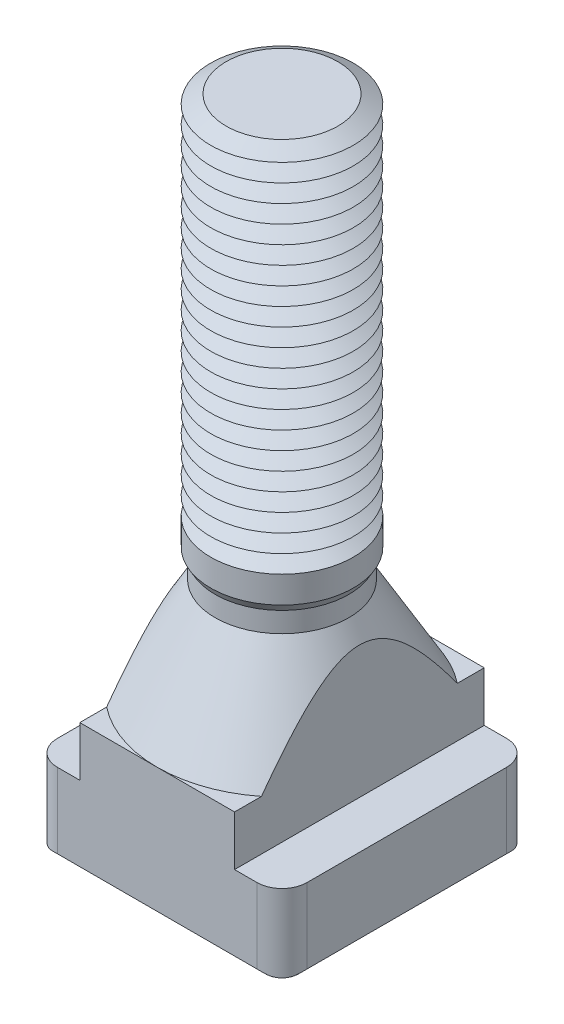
ISO-10303-21;
HEADER;
FILE_DESCRIPTION(('STEP AP214'),'2;1');
FILE_NAME('part.step','',(''),(''),'','','');
FILE_SCHEMA(('AUTOMOTIVE_DESIGN { 1 0 10303 214 1 1 1 1 }'));
ENDSEC;
DATA;
#1=APPLICATION_CONTEXT('core data for automotive mechanical design processes');
#2=APPLICATION_PROTOCOL_DEFINITION('international standard','automotive_design',2000,#1);
#3=PRODUCT_CONTEXT('',#1,'mechanical');
#4=PRODUCT('Part','Part','',(#3));
#5=PRODUCT_RELATED_PRODUCT_CATEGORY('part','',(#4));
#6=PRODUCT_DEFINITION_FORMATION('','',#4);
#7=PRODUCT_DEFINITION_CONTEXT('part definition',#1,'design');
#8=PRODUCT_DEFINITION('design','',#6,#7);
#9=PRODUCT_DEFINITION_SHAPE('','',#8);
#10=(LENGTH_UNIT() NAMED_UNIT(*) SI_UNIT(.MILLI.,.METRE.));
#11=(NAMED_UNIT(*) PLANE_ANGLE_UNIT() SI_UNIT($,.RADIAN.));
#12=(NAMED_UNIT(*) SI_UNIT($,.STERADIAN.) SOLID_ANGLE_UNIT());
#13=UNCERTAINTY_MEASURE_WITH_UNIT(LENGTH_MEASURE(1.E-05),#10,'distance_accuracy_value','');
#14=(GEOMETRIC_REPRESENTATION_CONTEXT(3) GLOBAL_UNCERTAINTY_ASSIGNED_CONTEXT((#13)) GLOBAL_UNIT_ASSIGNED_CONTEXT((#10,
#11,#12)) REPRESENTATION_CONTEXT('',''));
#15=CARTESIAN_POINT('',(0.,0.,0.));
#16=DIRECTION('',(0.,0.,1.));
#17=DIRECTION('',(1.,0.,0.));
#18=AXIS2_PLACEMENT_3D('',#15,#16,#17);
#19=CARTESIAN_POINT('',(0.,84.,0.));
#20=DIRECTION('',(0.,-1.,0.));
#21=DIRECTION('',(0.,0.,-1.));
#22=AXIS2_PLACEMENT_3D('',#19,#20,#21);
#23=CONICAL_SURFACE('',#22,7.83493649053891,1.0471975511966);
#24=CARTESIAN_POINT('',(0.,82.75,0.));
#25=DIRECTION('',(0.,-1.,0.));
#26=DIRECTION('',(0.,0.,-1.));
#27=AXIS2_PLACEMENT_3D('',#24,#25,#26);
#28=CIRCLE('',#27,10.);
#29=CARTESIAN_POINT('',(0.,82.75,-10.));
#30=VERTEX_POINT('',#29);
#31=EDGE_CURVE('E710',#30,#30,#28,.T.);
#32=ORIENTED_EDGE('',*,*,#31,.F.);
#33=EDGE_LOOP('',(#32));
#34=FACE_BOUND('',#33,.T.);
#35=CARTESIAN_POINT('',(0.,84.,0.));
#36=DIRECTION('',(0.,-1.,0.));
#37=DIRECTION('',(0.,0.,-1.));
#38=AXIS2_PLACEMENT_3D('',#35,#36,#37);
#39=CIRCLE('',#38,7.83493649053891);
#40=CARTESIAN_POINT('',(0.,84.,-7.83493649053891));
#41=VERTEX_POINT('',#40);
#42=EDGE_CURVE('E706',#41,#41,#39,.T.);
#43=ORIENTED_EDGE('',*,*,#42,.T.);
#44=EDGE_LOOP('',(#43));
#45=FACE_BOUND('',#44,.T.);
#46=ADVANCED_FACE('F39',(#34,#45),#23,.T.);
#47=CARTESIAN_POINT('',(0.,85.25,0.));
#48=DIRECTION('',(0.,1.,0.));
#49=DIRECTION('',(0.,0.,1.));
#50=AXIS2_PLACEMENT_3D('',#47,#48,#49);
#51=CONICAL_SURFACE('',#50,10.,1.0471975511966);
#52=ORIENTED_EDGE('',*,*,#42,.F.);
#53=EDGE_LOOP('',(#52));
#54=FACE_BOUND('',#53,.T.);
#55=CARTESIAN_POINT('',(0.,85.25,0.));
#56=DIRECTION('',(0.,-1.,0.));
#57=DIRECTION('',(0.,0.,-1.));
#58=AXIS2_PLACEMENT_3D('',#55,#56,#57);
#59=CIRCLE('',#58,10.);
#60=CARTESIAN_POINT('',(0.,85.25,-10.));
#61=VERTEX_POINT('',#60);
#62=EDGE_CURVE('E709',#61,#61,#59,.T.);
#63=ORIENTED_EDGE('',*,*,#62,.T.);
#64=EDGE_LOOP('',(#63));
#65=FACE_BOUND('',#64,.T.);
#66=ADVANCED_FACE('F449',(#54,#65),#51,.T.);
#67=CARTESIAN_POINT('',(4.0713006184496,94.,0.));
#68=DIRECTION('',(0.,-1.,0.));
#69=DIRECTION('',(1.,0.,0.));
#70=AXIS2_PLACEMENT_3D('',#67,#68,#69);
#71=PLANE('',#70);
#72=CARTESIAN_POINT('',(0.,94.,0.));
#73=DIRECTION('',(0.,-1.,0.));
#74=DIRECTION('',(0.,0.,-1.));
#75=AXIS2_PLACEMENT_3D('',#72,#73,#74);
#76=CIRCLE('',#75,7.83493649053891);
#77=CARTESIAN_POINT('',(0.,94.,-7.83493649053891));
#78=VERTEX_POINT('',#77);
#79=EDGE_CURVE('E692',#78,#78,#76,.T.);
#80=ORIENTED_EDGE('',*,*,#79,.F.);
#81=EDGE_LOOP('',(#80));
#82=FACE_BOUND('',#81,.T.);
#83=ADVANCED_FACE('F455',(#82),#71,.F.);
#84=CARTESIAN_POINT('',(0.,94.,0.));
#85=DIRECTION('',(0.,-1.,0.));
#86=DIRECTION('',(0.,0.,-1.));
#87=AXIS2_PLACEMENT_3D('',#84,#85,#86);
#88=CONICAL_SURFACE('',#87,7.83493649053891,1.0471975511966);
#89=CARTESIAN_POINT('',(0.,92.75,0.));
#90=DIRECTION('',(0.,-1.,0.));
#91=DIRECTION('',(0.,0.,-1.));
#92=AXIS2_PLACEMENT_3D('',#89,#90,#91);
#93=CIRCLE('',#92,10.);
#94=CARTESIAN_POINT('',(0.,92.75,-10.));
#95=VERTEX_POINT('',#94);
#96=EDGE_CURVE('E695',#95,#95,#93,.T.);
#97=ORIENTED_EDGE('',*,*,#96,.F.);
#98=EDGE_LOOP('',(#97));
#99=FACE_BOUND('',#98,.T.);
#100=ORIENTED_EDGE('',*,*,#79,.T.);
#101=EDGE_LOOP('',(#100));
#102=FACE_BOUND('',#101,.T.);
#103=ADVANCED_FACE('F483',(#99,#102),#88,.T.);
#104=CARTESIAN_POINT('',(0.,92.75,0.));
#105=DIRECTION('',(0.,1.,0.));
#106=DIRECTION('',(0.,0.,1.));
#107=AXIS2_PLACEMENT_3D('',#104,#105,#106);
#108=CONICAL_SURFACE('',#107,10.,1.0471975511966);
#109=CARTESIAN_POINT('',(0.,91.5,0.));
#110=DIRECTION('',(0.,-1.,0.));
#111=DIRECTION('',(0.,0.,-1.));
#112=AXIS2_PLACEMENT_3D('',#109,#110,#111);
#113=CIRCLE('',#112,7.83493649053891);
#114=CARTESIAN_POINT('',(0.,91.5,-7.83493649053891));
#115=VERTEX_POINT('',#114);
#116=EDGE_CURVE('E718',#115,#115,#113,.T.);
#117=ORIENTED_EDGE('',*,*,#116,.F.);
#118=EDGE_LOOP('',(#117));
#119=FACE_BOUND('',#118,.T.);
#120=ORIENTED_EDGE('',*,*,#96,.T.);
#121=EDGE_LOOP('',(#120));
#122=FACE_BOUND('',#121,.T.);
#123=ADVANCED_FACE('F480',(#119,#122),#108,.T.);
#124=CARTESIAN_POINT('',(0.,91.5,0.));
#125=DIRECTION('',(0.,-1.,0.));
#126=DIRECTION('',(0.,0.,-1.));
#127=AXIS2_PLACEMENT_3D('',#124,#125,#126);
#128=CONICAL_SURFACE('',#127,7.83493649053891,1.0471975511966);
#129=CARTESIAN_POINT('',(0.,90.25,0.));
#130=DIRECTION('',(0.,-1.,0.));
#131=DIRECTION('',(0.,0.,-1.));
#132=AXIS2_PLACEMENT_3D('',#129,#130,#131);
#133=CIRCLE('',#132,10.);
#134=CARTESIAN_POINT('',(0.,90.25,-10.));
#135=VERTEX_POINT('',#134);
#136=EDGE_CURVE('E643',#135,#135,#133,.T.);
#137=ORIENTED_EDGE('',*,*,#136,.F.);
#138=EDGE_LOOP('',(#137));
#139=FACE_BOUND('',#138,.T.);
#140=ORIENTED_EDGE('',*,*,#116,.T.);
#141=EDGE_LOOP('',(#140));
#142=FACE_BOUND('',#141,.T.);
#143=ADVANCED_FACE('F475',(#139,#142),#128,.T.);
#144=CARTESIAN_POINT('',(0.,90.25,0.));
#145=DIRECTION('',(0.,1.,0.));
#146=DIRECTION('',(0.,0.,1.));
#147=AXIS2_PLACEMENT_3D('',#144,#145,#146);
#148=CONICAL_SURFACE('',#147,10.,1.0471975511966);
#149=CARTESIAN_POINT('',(0.,89.,0.));
#150=DIRECTION('',(0.,-1.,0.));
#151=DIRECTION('',(0.,0.,-1.));
#152=AXIS2_PLACEMENT_3D('',#149,#150,#151);
#153=CIRCLE('',#152,7.83493649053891);
#154=CARTESIAN_POINT('',(0.,89.,-7.83493649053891));
#155=VERTEX_POINT('',#154);
#156=EDGE_CURVE('E640',#155,#155,#153,.T.);
#157=ORIENTED_EDGE('',*,*,#156,.F.);
#158=EDGE_LOOP('',(#157));
#159=FACE_BOUND('',#158,.T.);
#160=ORIENTED_EDGE('',*,*,#136,.T.);
#161=EDGE_LOOP('',(#160));
#162=FACE_BOUND('',#161,.T.);
#163=ADVANCED_FACE('F472',(#159,#162),#148,.T.);
#164=CARTESIAN_POINT('',(0.,89.,0.));
#165=DIRECTION('',(0.,-1.,0.));
#166=DIRECTION('',(0.,0.,-1.));
#167=AXIS2_PLACEMENT_3D('',#164,#165,#166);
#168=CONICAL_SURFACE('',#167,7.83493649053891,1.0471975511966);
#169=CARTESIAN_POINT('',(0.,87.75,0.));
#170=DIRECTION('',(0.,-1.,0.));
#171=DIRECTION('',(0.,0.,-1.));
#172=AXIS2_PLACEMENT_3D('',#169,#170,#171);
#173=CIRCLE('',#172,10.);
#174=CARTESIAN_POINT('',(0.,87.75,-10.));
#175=VERTEX_POINT('',#174);
#176=EDGE_CURVE('E644',#175,#175,#173,.T.);
#177=ORIENTED_EDGE('',*,*,#176,.F.);
#178=EDGE_LOOP('',(#177));
#179=FACE_BOUND('',#178,.T.);
#180=ORIENTED_EDGE('',*,*,#156,.T.);
#181=EDGE_LOOP('',(#180));
#182=FACE_BOUND('',#181,.T.);
#183=ADVANCED_FACE('F466',(#179,#182),#168,.T.);
#184=CARTESIAN_POINT('',(0.,87.75,0.));
#185=DIRECTION('',(0.,1.,0.));
#186=DIRECTION('',(0.,0.,1.));
#187=AXIS2_PLACEMENT_3D('',#184,#185,#186);
#188=CONICAL_SURFACE('',#187,10.,1.0471975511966);
#189=CARTESIAN_POINT('',(0.,86.5,0.));
#190=DIRECTION('',(0.,-1.,0.));
#191=DIRECTION('',(0.,0.,-1.));
#192=AXIS2_PLACEMENT_3D('',#189,#190,#191);
#193=CIRCLE('',#192,7.83493649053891);
#194=CARTESIAN_POINT('',(0.,86.5,-7.83493649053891));
#195=VERTEX_POINT('',#194);
#196=EDGE_CURVE('E791',#195,#195,#193,.T.);
#197=ORIENTED_EDGE('',*,*,#196,.F.);
#198=EDGE_LOOP('',(#197));
#199=FACE_BOUND('',#198,.T.);
#200=ORIENTED_EDGE('',*,*,#176,.T.);
#201=EDGE_LOOP('',(#200));
#202=FACE_BOUND('',#201,.T.);
#203=ADVANCED_FACE('F462',(#199,#202),#188,.T.);
#204=CARTESIAN_POINT('',(0.,86.5,0.));
#205=DIRECTION('',(0.,-1.,0.));
#206=DIRECTION('',(0.,0.,-1.));
#207=AXIS2_PLACEMENT_3D('',#204,#205,#206);
#208=CONICAL_SURFACE('',#207,7.83493649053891,1.0471975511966);
#209=ORIENTED_EDGE('',*,*,#62,.F.);
#210=EDGE_LOOP('',(#209));
#211=FACE_BOUND('',#210,.T.);
#212=ORIENTED_EDGE('',*,*,#196,.T.);
#213=EDGE_LOOP('',(#212));
#214=FACE_BOUND('',#213,.T.);
#215=ADVANCED_FACE('F465',(#211,#214),#208,.T.);
#216=CARTESIAN_POINT('',(0.,81.5,0.));
#217=DIRECTION('',(0.,-1.,0.));
#218=DIRECTION('',(0.,0.,-1.));
#219=AXIS2_PLACEMENT_3D('',#216,#217,#218);
#220=CONICAL_SURFACE('',#219,7.83493649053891,1.0471975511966);
#221=CARTESIAN_POINT('',(0.,80.25,0.));
#222=DIRECTION('',(0.,-1.,0.));
#223=DIRECTION('',(0.,0.,-1.));
#224=AXIS2_PLACEMENT_3D('',#221,#222,#223);
#225=CIRCLE('',#224,10.);
#226=CARTESIAN_POINT('',(0.,80.25,-10.));
#227=VERTEX_POINT('',#226);
#228=EDGE_CURVE('E682',#227,#227,#225,.T.);
#229=ORIENTED_EDGE('',*,*,#228,.F.);
#230=EDGE_LOOP('',(#229));
#231=FACE_BOUND('',#230,.T.);
#232=CARTESIAN_POINT('',(0.,81.5,0.));
#233=DIRECTION('',(0.,-1.,0.));
#234=DIRECTION('',(0.,0.,-1.));
#235=AXIS2_PLACEMENT_3D('',#232,#233,#234);
#236=CIRCLE('',#235,7.83493649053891);
#237=CARTESIAN_POINT('',(0.,81.5,-7.83493649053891));
#238=VERTEX_POINT('',#237);
#239=EDGE_CURVE('E685',#238,#238,#236,.T.);
#240=ORIENTED_EDGE('',*,*,#239,.T.);
#241=EDGE_LOOP('',(#240));
#242=FACE_BOUND('',#241,.T.);
#243=ADVANCED_FACE('F470',(#231,#242),#220,.T.);
#244=CARTESIAN_POINT('',(0.,82.75,0.));
#245=DIRECTION('',(0.,1.,0.));
#246=DIRECTION('',(0.,0.,1.));
#247=AXIS2_PLACEMENT_3D('',#244,#245,#246);
#248=CONICAL_SURFACE('',#247,10.,1.0471975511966);
#249=ORIENTED_EDGE('',*,*,#239,.F.);
#250=EDGE_LOOP('',(#249));
#251=FACE_BOUND('',#250,.T.);
#252=ORIENTED_EDGE('',*,*,#31,.T.);
#253=EDGE_LOOP('',(#252));
#254=FACE_BOUND('',#253,.T.);
#255=ADVANCED_FACE('F1148',(#251,#254),#248,.T.);
#256=CARTESIAN_POINT('',(0.,79.,0.));
#257=DIRECTION('',(0.,-1.,0.));
#258=DIRECTION('',(0.,0.,-1.));
#259=AXIS2_PLACEMENT_3D('',#256,#257,#258);
#260=CONICAL_SURFACE('',#259,7.83493649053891,1.0471975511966);
#261=CARTESIAN_POINT('',(0.,77.75,0.));
#262=DIRECTION('',(0.,-1.,0.));
#263=DIRECTION('',(0.,0.,-1.));
#264=AXIS2_PLACEMENT_3D('',#261,#262,#263);
#265=CIRCLE('',#264,10.);
#266=CARTESIAN_POINT('',(0.,77.75,-10.));
#267=VERTEX_POINT('',#266);
#268=EDGE_CURVE('E722',#267,#267,#265,.T.);
#269=ORIENTED_EDGE('',*,*,#268,.F.);
#270=EDGE_LOOP('',(#269));
#271=FACE_BOUND('',#270,.T.);
#272=CARTESIAN_POINT('',(0.,79.,0.));
#273=DIRECTION('',(0.,-1.,0.));
#274=DIRECTION('',(0.,0.,-1.));
#275=AXIS2_PLACEMENT_3D('',#272,#273,#274);
#276=CIRCLE('',#275,7.83493649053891);
#277=CARTESIAN_POINT('',(0.,79.,-7.83493649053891));
#278=VERTEX_POINT('',#277);
#279=EDGE_CURVE('E686',#278,#278,#276,.T.);
#280=ORIENTED_EDGE('',*,*,#279,.T.);
#281=EDGE_LOOP('',(#280));
#282=FACE_BOUND('',#281,.T.);
#283=ADVANCED_FACE('F1138',(#271,#282),#260,.T.);
#284=CARTESIAN_POINT('',(0.,80.25,0.));
#285=DIRECTION('',(0.,1.,0.));
#286=DIRECTION('',(0.,0.,1.));
#287=AXIS2_PLACEMENT_3D('',#284,#285,#286);
#288=CONICAL_SURFACE('',#287,10.,1.0471975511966);
#289=ORIENTED_EDGE('',*,*,#279,.F.);
#290=EDGE_LOOP('',(#289));
#291=FACE_BOUND('',#290,.T.);
#292=ORIENTED_EDGE('',*,*,#228,.T.);
#293=EDGE_LOOP('',(#292));
#294=FACE_BOUND('',#293,.T.);
#295=ADVANCED_FACE('F1128',(#291,#294),#288,.T.);
#296=CARTESIAN_POINT('',(0.,76.5,0.));
#297=DIRECTION('',(0.,-1.,0.));
#298=DIRECTION('',(0.,0.,-1.));
#299=AXIS2_PLACEMENT_3D('',#296,#297,#298);
#300=CONICAL_SURFACE('',#299,7.83493649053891,1.0471975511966);
#301=CARTESIAN_POINT('',(0.,75.25,0.));
#302=DIRECTION('',(0.,-1.,0.));
#303=DIRECTION('',(0.,0.,-1.));
#304=AXIS2_PLACEMENT_3D('',#301,#302,#303);
#305=CIRCLE('',#304,10.);
#306=CARTESIAN_POINT('',(0.,75.25,-10.));
#307=VERTEX_POINT('',#306);
#308=EDGE_CURVE('E646',#307,#307,#305,.T.);
#309=ORIENTED_EDGE('',*,*,#308,.F.);
#310=EDGE_LOOP('',(#309));
#311=FACE_BOUND('',#310,.T.);
#312=CARTESIAN_POINT('',(0.,76.5,0.));
#313=DIRECTION('',(0.,-1.,0.));
#314=DIRECTION('',(0.,0.,-1.));
#315=AXIS2_PLACEMENT_3D('',#312,#313,#314);
#316=CIRCLE('',#315,7.83493649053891);
#317=CARTESIAN_POINT('',(0.,76.5,-7.83493649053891));
#318=VERTEX_POINT('',#317);
#319=EDGE_CURVE('E649',#318,#318,#316,.T.);
#320=ORIENTED_EDGE('',*,*,#319,.T.);
#321=EDGE_LOOP('',(#320));
#322=FACE_BOUND('',#321,.T.);
#323=ADVANCED_FACE('F1118',(#311,#322),#300,.T.);
#324=CARTESIAN_POINT('',(0.,77.75,0.));
#325=DIRECTION('',(0.,1.,0.));
#326=DIRECTION('',(0.,0.,1.));
#327=AXIS2_PLACEMENT_3D('',#324,#325,#326);
#328=CONICAL_SURFACE('',#327,10.,1.0471975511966);
#329=ORIENTED_EDGE('',*,*,#319,.F.);
#330=EDGE_LOOP('',(#329));
#331=FACE_BOUND('',#330,.T.);
#332=ORIENTED_EDGE('',*,*,#268,.T.);
#333=EDGE_LOOP('',(#332));
#334=FACE_BOUND('',#333,.T.);
#335=ADVANCED_FACE('F1108',(#331,#334),#328,.T.);
#336=CARTESIAN_POINT('',(0.,74.,0.));
#337=DIRECTION('',(0.,-1.,0.));
#338=DIRECTION('',(0.,0.,-1.));
#339=AXIS2_PLACEMENT_3D('',#336,#337,#338);
#340=CONICAL_SURFACE('',#339,7.83493649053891,1.0471975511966);
#341=CARTESIAN_POINT('',(0.,72.75,0.));
#342=DIRECTION('',(0.,-1.,0.));
#343=DIRECTION('',(0.,0.,-1.));
#344=AXIS2_PLACEMENT_3D('',#341,#342,#343);
#345=CIRCLE('',#344,10.);
#346=CARTESIAN_POINT('',(0.,72.75,-10.));
#347=VERTEX_POINT('',#346);
#348=EDGE_CURVE('E689',#347,#347,#345,.T.);
#349=ORIENTED_EDGE('',*,*,#348,.F.);
#350=EDGE_LOOP('',(#349));
#351=FACE_BOUND('',#350,.T.);
#352=CARTESIAN_POINT('',(0.,74.,0.));
#353=DIRECTION('',(0.,-1.,0.));
#354=DIRECTION('',(0.,0.,-1.));
#355=AXIS2_PLACEMENT_3D('',#352,#353,#354);
#356=CIRCLE('',#355,7.83493649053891);
#357=CARTESIAN_POINT('',(0.,74.,-7.83493649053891));
#358=VERTEX_POINT('',#357);
#359=EDGE_CURVE('E650',#358,#358,#356,.T.);
#360=ORIENTED_EDGE('',*,*,#359,.T.);
#361=EDGE_LOOP('',(#360));
#362=FACE_BOUND('',#361,.T.);
#363=ADVANCED_FACE('F1098',(#351,#362),#340,.T.);
#364=CARTESIAN_POINT('',(0.,75.25,0.));
#365=DIRECTION('',(0.,1.,0.));
#366=DIRECTION('',(0.,0.,1.));
#367=AXIS2_PLACEMENT_3D('',#364,#365,#366);
#368=CONICAL_SURFACE('',#367,10.,1.0471975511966);
#369=ORIENTED_EDGE('',*,*,#359,.F.);
#370=EDGE_LOOP('',(#369));
#371=FACE_BOUND('',#370,.T.);
#372=ORIENTED_EDGE('',*,*,#308,.T.);
#373=EDGE_LOOP('',(#372));
#374=FACE_BOUND('',#373,.T.);
#375=ADVANCED_FACE('F1088',(#371,#374),#368,.T.);
#376=CARTESIAN_POINT('',(0.,71.5,0.));
#377=DIRECTION('',(0.,-1.,0.));
#378=DIRECTION('',(0.,0.,-1.));
#379=AXIS2_PLACEMENT_3D('',#376,#377,#378);
#380=CONICAL_SURFACE('',#379,7.83493649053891,1.0471975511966);
#381=CARTESIAN_POINT('',(0.,70.25,0.));
#382=DIRECTION('',(0.,-1.,0.));
#383=DIRECTION('',(0.,0.,-1.));
#384=AXIS2_PLACEMENT_3D('',#381,#382,#383);
#385=CIRCLE('',#384,10.);
#386=CARTESIAN_POINT('',(0.,70.25,-10.));
#387=VERTEX_POINT('',#386);
#388=EDGE_CURVE('E636',#387,#387,#385,.T.);
#389=ORIENTED_EDGE('',*,*,#388,.F.);
#390=EDGE_LOOP('',(#389));
#391=FACE_BOUND('',#390,.T.);
#392=CARTESIAN_POINT('',(0.,71.5,0.));
#393=DIRECTION('',(0.,-1.,0.));
#394=DIRECTION('',(0.,0.,-1.));
#395=AXIS2_PLACEMENT_3D('',#392,#393,#394);
#396=CIRCLE('',#395,7.83493649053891);
#397=CARTESIAN_POINT('',(0.,71.5,-7.83493649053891));
#398=VERTEX_POINT('',#397);
#399=EDGE_CURVE('E769',#398,#398,#396,.T.);
#400=ORIENTED_EDGE('',*,*,#399,.T.);
#401=EDGE_LOOP('',(#400));
#402=FACE_BOUND('',#401,.T.);
#403=ADVANCED_FACE('F1078',(#391,#402),#380,.T.);
#404=CARTESIAN_POINT('',(0.,72.75,0.));
#405=DIRECTION('',(0.,1.,0.));
#406=DIRECTION('',(0.,0.,1.));
#407=AXIS2_PLACEMENT_3D('',#404,#405,#406);
#408=CONICAL_SURFACE('',#407,10.,1.0471975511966);
#409=ORIENTED_EDGE('',*,*,#399,.F.);
#410=EDGE_LOOP('',(#409));
#411=FACE_BOUND('',#410,.T.);
#412=ORIENTED_EDGE('',*,*,#348,.T.);
#413=EDGE_LOOP('',(#412));
#414=FACE_BOUND('',#413,.T.);
#415=ADVANCED_FACE('F1068',(#411,#414),#408,.T.);
#416=CARTESIAN_POINT('',(0.,69.,0.));
#417=DIRECTION('',(0.,-1.,0.));
#418=DIRECTION('',(0.,0.,-1.));
#419=AXIS2_PLACEMENT_3D('',#416,#417,#418);
#420=CONICAL_SURFACE('',#419,7.83493649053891,1.0471975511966);
#421=CARTESIAN_POINT('',(0.,67.75,0.));
#422=DIRECTION('',(0.,-1.,0.));
#423=DIRECTION('',(0.,0.,-1.));
#424=AXIS2_PLACEMENT_3D('',#421,#422,#423);
#425=CIRCLE('',#424,10.);
#426=CARTESIAN_POINT('',(0.,67.75,-10.));
#427=VERTEX_POINT('',#426);
#428=EDGE_CURVE('E637',#427,#427,#425,.T.);
#429=ORIENTED_EDGE('',*,*,#428,.F.);
#430=EDGE_LOOP('',(#429));
#431=FACE_BOUND('',#430,.T.);
#432=CARTESIAN_POINT('',(0.,69.,0.));
#433=DIRECTION('',(0.,-1.,0.));
#434=DIRECTION('',(0.,0.,-1.));
#435=AXIS2_PLACEMENT_3D('',#432,#433,#434);
#436=CIRCLE('',#435,7.83493649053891);
#437=CARTESIAN_POINT('',(0.,69.,-7.83493649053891));
#438=VERTEX_POINT('',#437);
#439=EDGE_CURVE('E634',#438,#438,#436,.T.);
#440=ORIENTED_EDGE('',*,*,#439,.T.);
#441=EDGE_LOOP('',(#440));
#442=FACE_BOUND('',#441,.T.);
#443=ADVANCED_FACE('F1058',(#431,#442),#420,.T.);
#444=CARTESIAN_POINT('',(0.,70.25,0.));
#445=DIRECTION('',(0.,1.,0.));
#446=DIRECTION('',(0.,0.,1.));
#447=AXIS2_PLACEMENT_3D('',#444,#445,#446);
#448=CONICAL_SURFACE('',#447,10.,1.0471975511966);
#449=ORIENTED_EDGE('',*,*,#439,.F.);
#450=EDGE_LOOP('',(#449));
#451=FACE_BOUND('',#450,.T.);
#452=ORIENTED_EDGE('',*,*,#388,.T.);
#453=EDGE_LOOP('',(#452));
#454=FACE_BOUND('',#453,.T.);
#455=ADVANCED_FACE('F1048',(#451,#454),#448,.T.);
#456=CARTESIAN_POINT('',(0.,66.5,0.));
#457=DIRECTION('',(0.,-1.,0.));
#458=DIRECTION('',(0.,0.,-1.));
#459=AXIS2_PLACEMENT_3D('',#456,#457,#458);
#460=CONICAL_SURFACE('',#459,7.83493649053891,1.0471975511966);
#461=CARTESIAN_POINT('',(0.,65.25,0.));
#462=DIRECTION('',(0.,-1.,0.));
#463=DIRECTION('',(0.,0.,-1.));
#464=AXIS2_PLACEMENT_3D('',#461,#462,#463);
#465=CIRCLE('',#464,10.);
#466=CARTESIAN_POINT('',(0.,65.25,-10.));
#467=VERTEX_POINT('',#466);
#468=EDGE_CURVE('E760',#467,#467,#465,.T.);
#469=ORIENTED_EDGE('',*,*,#468,.F.);
#470=EDGE_LOOP('',(#469));
#471=FACE_BOUND('',#470,.T.);
#472=CARTESIAN_POINT('',(0.,66.5,0.));
#473=DIRECTION('',(0.,-1.,0.));
#474=DIRECTION('',(0.,0.,-1.));
#475=AXIS2_PLACEMENT_3D('',#472,#473,#474);
#476=CIRCLE('',#475,7.83493649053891);
#477=CARTESIAN_POINT('',(0.,66.5,-7.83493649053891));
#478=VERTEX_POINT('',#477);
#479=EDGE_CURVE('E713',#478,#478,#476,.T.);
#480=ORIENTED_EDGE('',*,*,#479,.T.);
#481=EDGE_LOOP('',(#480));
#482=FACE_BOUND('',#481,.T.);
#483=ADVANCED_FACE('F1038',(#471,#482),#460,.T.);
#484=CARTESIAN_POINT('',(0.,67.75,0.));
#485=DIRECTION('',(0.,1.,0.));
#486=DIRECTION('',(0.,0.,1.));
#487=AXIS2_PLACEMENT_3D('',#484,#485,#486);
#488=CONICAL_SURFACE('',#487,10.,1.0471975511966);
#489=ORIENTED_EDGE('',*,*,#479,.F.);
#490=EDGE_LOOP('',(#489));
#491=FACE_BOUND('',#490,.T.);
#492=ORIENTED_EDGE('',*,*,#428,.T.);
#493=EDGE_LOOP('',(#492));
#494=FACE_BOUND('',#493,.T.);
#495=ADVANCED_FACE('F1028',(#491,#494),#488,.T.);
#496=CARTESIAN_POINT('',(0.,64.,0.));
#497=DIRECTION('',(0.,-1.,0.));
#498=DIRECTION('',(0.,0.,-1.));
#499=AXIS2_PLACEMENT_3D('',#496,#497,#498);
#500=CONICAL_SURFACE('',#499,7.83493649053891,1.0471975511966);
#501=CARTESIAN_POINT('',(0.,62.75,0.));
#502=DIRECTION('',(0.,-1.,0.));
#503=DIRECTION('',(0.,0.,-1.));
#504=AXIS2_PLACEMENT_3D('',#501,#502,#503);
#505=CIRCLE('',#504,10.);
#506=CARTESIAN_POINT('',(0.,62.75,-10.));
#507=VERTEX_POINT('',#506);
#508=EDGE_CURVE('E666',#507,#507,#505,.T.);
#509=ORIENTED_EDGE('',*,*,#508,.F.);
#510=EDGE_LOOP('',(#509));
#511=FACE_BOUND('',#510,.T.);
#512=CARTESIAN_POINT('',(0.,64.,0.));
#513=DIRECTION('',(0.,-1.,0.));
#514=DIRECTION('',(0.,0.,-1.));
#515=AXIS2_PLACEMENT_3D('',#512,#513,#514);
#516=CIRCLE('',#515,7.83493649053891);
#517=CARTESIAN_POINT('',(0.,64.,-7.83493649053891));
#518=VERTEX_POINT('',#517);
#519=EDGE_CURVE('E669',#518,#518,#516,.T.);
#520=ORIENTED_EDGE('',*,*,#519,.T.);
#521=EDGE_LOOP('',(#520));
#522=FACE_BOUND('',#521,.T.);
#523=ADVANCED_FACE('F1018',(#511,#522),#500,.T.);
#524=CARTESIAN_POINT('',(0.,65.25,0.));
#525=DIRECTION('',(0.,1.,0.));
#526=DIRECTION('',(0.,0.,1.));
#527=AXIS2_PLACEMENT_3D('',#524,#525,#526);
#528=CONICAL_SURFACE('',#527,10.,1.0471975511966);
#529=ORIENTED_EDGE('',*,*,#519,.F.);
#530=EDGE_LOOP('',(#529));
#531=FACE_BOUND('',#530,.T.);
#532=ORIENTED_EDGE('',*,*,#468,.T.);
#533=EDGE_LOOP('',(#532));
#534=FACE_BOUND('',#533,.T.);
#535=ADVANCED_FACE('F1008',(#531,#534),#528,.T.);
#536=CARTESIAN_POINT('',(0.,61.5,0.));
#537=DIRECTION('',(0.,-1.,0.));
#538=DIRECTION('',(0.,0.,-1.));
#539=AXIS2_PLACEMENT_3D('',#536,#537,#538);
#540=CONICAL_SURFACE('',#539,7.83493649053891,1.0471975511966);
#541=CARTESIAN_POINT('',(0.,60.25,0.));
#542=DIRECTION('',(0.,-1.,0.));
#543=DIRECTION('',(0.,0.,-1.));
#544=AXIS2_PLACEMENT_3D('',#541,#542,#543);
#545=CIRCLE('',#544,10.);
#546=CARTESIAN_POINT('',(0.,60.25,-10.));
#547=VERTEX_POINT('',#546);
#548=EDGE_CURVE('E699',#547,#547,#545,.T.);
#549=ORIENTED_EDGE('',*,*,#548,.F.);
#550=EDGE_LOOP('',(#549));
#551=FACE_BOUND('',#550,.T.);
#552=CARTESIAN_POINT('',(0.,61.5,0.));
#553=DIRECTION('',(0.,-1.,0.));
#554=DIRECTION('',(0.,0.,-1.));
#555=AXIS2_PLACEMENT_3D('',#552,#553,#554);
#556=CIRCLE('',#555,7.83493649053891);
#557=CARTESIAN_POINT('',(0.,61.5,-7.83493649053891));
#558=VERTEX_POINT('',#557);
#559=EDGE_CURVE('E670',#558,#558,#556,.T.);
#560=ORIENTED_EDGE('',*,*,#559,.T.);
#561=EDGE_LOOP('',(#560));
#562=FACE_BOUND('',#561,.T.);
#563=ADVANCED_FACE('F998',(#551,#562),#540,.T.);
#564=CARTESIAN_POINT('',(0.,62.75,0.));
#565=DIRECTION('',(0.,1.,0.));
#566=DIRECTION('',(0.,0.,1.));
#567=AXIS2_PLACEMENT_3D('',#564,#565,#566);
#568=CONICAL_SURFACE('',#567,10.,1.0471975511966);
#569=ORIENTED_EDGE('',*,*,#559,.F.);
#570=EDGE_LOOP('',(#569));
#571=FACE_BOUND('',#570,.T.);
#572=ORIENTED_EDGE('',*,*,#508,.T.);
#573=EDGE_LOOP('',(#572));
#574=FACE_BOUND('',#573,.T.);
#575=ADVANCED_FACE('F988',(#571,#574),#568,.T.);
#576=CARTESIAN_POINT('',(0.,59.,0.));
#577=DIRECTION('',(0.,-1.,0.));
#578=DIRECTION('',(0.,0.,-1.));
#579=AXIS2_PLACEMENT_3D('',#576,#577,#578);
#580=CONICAL_SURFACE('',#579,7.83493649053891,1.0471975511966);
#581=CARTESIAN_POINT('',(0.,57.75,0.));
#582=DIRECTION('',(0.,-1.,0.));
#583=DIRECTION('',(0.,0.,-1.));
#584=AXIS2_PLACEMENT_3D('',#581,#582,#583);
#585=CIRCLE('',#584,10.);
#586=CARTESIAN_POINT('',(0.,57.75,-10.));
#587=VERTEX_POINT('',#586);
#588=EDGE_CURVE('E655',#587,#587,#585,.T.);
#589=ORIENTED_EDGE('',*,*,#588,.F.);
#590=EDGE_LOOP('',(#589));
#591=FACE_BOUND('',#590,.T.);
#592=CARTESIAN_POINT('',(0.,59.,0.));
#593=DIRECTION('',(0.,-1.,0.));
#594=DIRECTION('',(0.,0.,-1.));
#595=AXIS2_PLACEMENT_3D('',#592,#593,#594);
#596=CIRCLE('',#595,7.83493649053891);
#597=CARTESIAN_POINT('',(0.,59.,-7.83493649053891));
#598=VERTEX_POINT('',#597);
#599=EDGE_CURVE('E750',#598,#598,#596,.T.);
#600=ORIENTED_EDGE('',*,*,#599,.T.);
#601=EDGE_LOOP('',(#600));
#602=FACE_BOUND('',#601,.T.);
#603=ADVANCED_FACE('F978',(#591,#602),#580,.T.);
#604=CARTESIAN_POINT('',(0.,60.25,0.));
#605=DIRECTION('',(0.,1.,0.));
#606=DIRECTION('',(0.,0.,1.));
#607=AXIS2_PLACEMENT_3D('',#604,#605,#606);
#608=CONICAL_SURFACE('',#607,10.,1.0471975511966);
#609=ORIENTED_EDGE('',*,*,#599,.F.);
#610=EDGE_LOOP('',(#609));
#611=FACE_BOUND('',#610,.T.);
#612=ORIENTED_EDGE('',*,*,#548,.T.);
#613=EDGE_LOOP('',(#612));
#614=FACE_BOUND('',#613,.T.);
#615=ADVANCED_FACE('F968',(#611,#614),#608,.T.);
#616=CARTESIAN_POINT('',(0.,56.5,0.));
#617=DIRECTION('',(0.,-1.,0.));
#618=DIRECTION('',(0.,0.,-1.));
#619=AXIS2_PLACEMENT_3D('',#616,#617,#618);
#620=CONICAL_SURFACE('',#619,7.83493649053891,1.0471975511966);
#621=CARTESIAN_POINT('',(0.,55.25,0.));
#622=DIRECTION('',(0.,-1.,0.));
#623=DIRECTION('',(0.,0.,-1.));
#624=AXIS2_PLACEMENT_3D('',#621,#622,#623);
#625=CIRCLE('',#624,10.);
#626=CARTESIAN_POINT('',(0.,55.25,-10.));
#627=VERTEX_POINT('',#626);
#628=EDGE_CURVE('E656',#627,#627,#625,.T.);
#629=ORIENTED_EDGE('',*,*,#628,.F.);
#630=EDGE_LOOP('',(#629));
#631=FACE_BOUND('',#630,.T.);
#632=CARTESIAN_POINT('',(0.,56.5,0.));
#633=DIRECTION('',(0.,-1.,0.));
#634=DIRECTION('',(0.,0.,-1.));
#635=AXIS2_PLACEMENT_3D('',#632,#633,#634);
#636=CIRCLE('',#635,7.83493649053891);
#637=CARTESIAN_POINT('',(0.,56.5,-7.83493649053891));
#638=VERTEX_POINT('',#637);
#639=EDGE_CURVE('E652',#638,#638,#636,.T.);
#640=ORIENTED_EDGE('',*,*,#639,.T.);
#641=EDGE_LOOP('',(#640));
#642=FACE_BOUND('',#641,.T.);
#643=ADVANCED_FACE('F958',(#631,#642),#620,.T.);
#644=CARTESIAN_POINT('',(0.,57.75,0.));
#645=DIRECTION('',(0.,1.,0.));
#646=DIRECTION('',(0.,0.,1.));
#647=AXIS2_PLACEMENT_3D('',#644,#645,#646);
#648=CONICAL_SURFACE('',#647,10.,1.0471975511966);
#649=ORIENTED_EDGE('',*,*,#639,.F.);
#650=EDGE_LOOP('',(#649));
#651=FACE_BOUND('',#650,.T.);
#652=ORIENTED_EDGE('',*,*,#588,.T.);
#653=EDGE_LOOP('',(#652));
#654=FACE_BOUND('',#653,.T.);
#655=ADVANCED_FACE('F948',(#651,#654),#648,.T.);
#656=CARTESIAN_POINT('',(0.,54.,0.));
#657=DIRECTION('',(0.,-1.,0.));
#658=DIRECTION('',(0.,0.,-1.));
#659=AXIS2_PLACEMENT_3D('',#656,#657,#658);
#660=CONICAL_SURFACE('',#659,7.83493649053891,1.0471975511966);
#661=CARTESIAN_POINT('',(0.,52.75,0.));
#662=DIRECTION('',(0.,-1.,0.));
#663=DIRECTION('',(0.,0.,-1.));
#664=AXIS2_PLACEMENT_3D('',#661,#662,#663);
#665=CIRCLE('',#664,10.);
#666=CARTESIAN_POINT('',(0.,52.75,-10.));
#667=VERTEX_POINT('',#666);
#668=EDGE_CURVE('E674',#667,#667,#665,.T.);
#669=ORIENTED_EDGE('',*,*,#668,.F.);
#670=EDGE_LOOP('',(#669));
#671=FACE_BOUND('',#670,.T.);
#672=CARTESIAN_POINT('',(0.,54.,0.));
#673=DIRECTION('',(0.,-1.,0.));
#674=DIRECTION('',(0.,0.,-1.));
#675=AXIS2_PLACEMENT_3D('',#672,#673,#674);
#676=CIRCLE('',#675,7.83493649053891);
#677=CARTESIAN_POINT('',(0.,54.,-7.83493649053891));
#678=VERTEX_POINT('',#677);
#679=EDGE_CURVE('E672',#678,#678,#676,.T.);
#680=ORIENTED_EDGE('',*,*,#679,.T.);
#681=EDGE_LOOP('',(#680));
#682=FACE_BOUND('',#681,.T.);
#683=ADVANCED_FACE('F938',(#671,#682),#660,.T.);
#684=CARTESIAN_POINT('',(0.,55.25,0.));
#685=DIRECTION('',(0.,1.,0.));
#686=DIRECTION('',(0.,0.,1.));
#687=AXIS2_PLACEMENT_3D('',#684,#685,#686);
#688=CONICAL_SURFACE('',#687,10.,1.0471975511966);
#689=ORIENTED_EDGE('',*,*,#679,.F.);
#690=EDGE_LOOP('',(#689));
#691=FACE_BOUND('',#690,.T.);
#692=ORIENTED_EDGE('',*,*,#628,.T.);
#693=EDGE_LOOP('',(#692));
#694=FACE_BOUND('',#693,.T.);
#695=ADVANCED_FACE('F928',(#691,#694),#688,.T.);
#696=CARTESIAN_POINT('',(0.,51.5,0.));
#697=DIRECTION('',(0.,-1.,0.));
#698=DIRECTION('',(0.,0.,-1.));
#699=AXIS2_PLACEMENT_3D('',#696,#697,#698);
#700=CONICAL_SURFACE('',#699,7.83493649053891,1.0471975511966);
#701=CARTESIAN_POINT('',(0.,50.25,0.));
#702=DIRECTION('',(0.,-1.,0.));
#703=DIRECTION('',(0.,0.,-1.));
#704=AXIS2_PLACEMENT_3D('',#701,#702,#703);
#705=CIRCLE('',#704,10.);
#706=CARTESIAN_POINT('',(0.,50.25,-10.));
#707=VERTEX_POINT('',#706);
#708=EDGE_CURVE('E736',#707,#707,#705,.T.);
#709=ORIENTED_EDGE('',*,*,#708,.F.);
#710=EDGE_LOOP('',(#709));
#711=FACE_BOUND('',#710,.T.);
#712=CARTESIAN_POINT('',(0.,51.5,0.));
#713=DIRECTION('',(0.,-1.,0.));
#714=DIRECTION('',(0.,0.,-1.));
#715=AXIS2_PLACEMENT_3D('',#712,#713,#714);
#716=CIRCLE('',#715,7.83493649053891);
#717=CARTESIAN_POINT('',(0.,51.5,-7.83493649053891));
#718=VERTEX_POINT('',#717);
#719=EDGE_CURVE('E740',#718,#718,#716,.T.);
#720=ORIENTED_EDGE('',*,*,#719,.T.);
#721=EDGE_LOOP('',(#720));
#722=FACE_BOUND('',#721,.T.);
#723=ADVANCED_FACE('F918',(#711,#722),#700,.T.);
#724=CARTESIAN_POINT('',(0.,52.75,0.));
#725=DIRECTION('',(0.,1.,0.));
#726=DIRECTION('',(0.,0.,1.));
#727=AXIS2_PLACEMENT_3D('',#724,#725,#726);
#728=CONICAL_SURFACE('',#727,10.,1.0471975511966);
#729=ORIENTED_EDGE('',*,*,#719,.F.);
#730=EDGE_LOOP('',(#729));
#731=FACE_BOUND('',#730,.T.);
#732=ORIENTED_EDGE('',*,*,#668,.T.);
#733=EDGE_LOOP('',(#732));
#734=FACE_BOUND('',#733,.T.);
#735=ADVANCED_FACE('F908',(#731,#734),#728,.T.);
#736=CARTESIAN_POINT('',(0.,49.,0.));
#737=DIRECTION('',(0.,-1.,0.));
#738=DIRECTION('',(0.,0.,-1.));
#739=AXIS2_PLACEMENT_3D('',#736,#737,#738);
#740=CONICAL_SURFACE('',#739,7.83493649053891,1.0471975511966);
#741=CARTESIAN_POINT('',(0.,47.75,0.));
#742=DIRECTION('',(0.,-1.,0.));
#743=DIRECTION('',(0.,0.,-1.));
#744=AXIS2_PLACEMENT_3D('',#741,#742,#743);
#745=CIRCLE('',#744,10.);
#746=CARTESIAN_POINT('',(0.,47.75,-10.));
#747=VERTEX_POINT('',#746);
#748=EDGE_CURVE('E701',#747,#747,#745,.T.);
#749=ORIENTED_EDGE('',*,*,#748,.F.);
#750=EDGE_LOOP('',(#749));
#751=FACE_BOUND('',#750,.T.);
#752=CARTESIAN_POINT('',(0.,49.,0.));
#753=DIRECTION('',(0.,-1.,0.));
#754=DIRECTION('',(0.,0.,-1.));
#755=AXIS2_PLACEMENT_3D('',#752,#753,#754);
#756=CIRCLE('',#755,7.83493649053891);
#757=CARTESIAN_POINT('',(0.,49.,-7.83493649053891));
#758=VERTEX_POINT('',#757);
#759=EDGE_CURVE('E703',#758,#758,#756,.T.);
#760=ORIENTED_EDGE('',*,*,#759,.T.);
#761=EDGE_LOOP('',(#760));
#762=FACE_BOUND('',#761,.T.);
#763=ADVANCED_FACE('F898',(#751,#762),#740,.T.);
#764=CARTESIAN_POINT('',(0.,50.25,0.));
#765=DIRECTION('',(0.,1.,0.));
#766=DIRECTION('',(0.,0.,1.));
#767=AXIS2_PLACEMENT_3D('',#764,#765,#766);
#768=CONICAL_SURFACE('',#767,10.,1.0471975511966);
#769=ORIENTED_EDGE('',*,*,#759,.F.);
#770=EDGE_LOOP('',(#769));
#771=FACE_BOUND('',#770,.T.);
#772=ORIENTED_EDGE('',*,*,#708,.T.);
#773=EDGE_LOOP('',(#772));
#774=FACE_BOUND('',#773,.T.);
#775=ADVANCED_FACE('F888',(#771,#774),#768,.T.);
#776=CARTESIAN_POINT('',(0.,46.5,0.));
#777=DIRECTION('',(0.,-1.,0.));
#778=DIRECTION('',(0.,0.,-1.));
#779=AXIS2_PLACEMENT_3D('',#776,#777,#778);
#780=CONICAL_SURFACE('',#779,7.83493649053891,1.0471975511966);
#781=CARTESIAN_POINT('',(0.,45.25,0.));
#782=DIRECTION('',(0.,-1.,0.));
#783=DIRECTION('',(0.,0.,-1.));
#784=AXIS2_PLACEMENT_3D('',#781,#782,#783);
#785=CIRCLE('',#784,10.);
#786=CARTESIAN_POINT('',(0.,45.25,-10.));
#787=VERTEX_POINT('',#786);
#788=EDGE_CURVE('E661',#787,#787,#785,.T.);
#789=ORIENTED_EDGE('',*,*,#788,.F.);
#790=EDGE_LOOP('',(#789));
#791=FACE_BOUND('',#790,.T.);
#792=CARTESIAN_POINT('',(0.,46.5,0.));
#793=DIRECTION('',(0.,-1.,0.));
#794=DIRECTION('',(0.,0.,-1.));
#795=AXIS2_PLACEMENT_3D('',#792,#793,#794);
#796=CIRCLE('',#795,7.83493649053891);
#797=CARTESIAN_POINT('',(0.,46.5,-7.83493649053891));
#798=VERTEX_POINT('',#797);
#799=EDGE_CURVE('E660',#798,#798,#796,.T.);
#800=ORIENTED_EDGE('',*,*,#799,.T.);
#801=EDGE_LOOP('',(#800));
#802=FACE_BOUND('',#801,.T.);
#803=ADVANCED_FACE('F878',(#791,#802),#780,.T.);
#804=CARTESIAN_POINT('',(0.,47.75,0.));
#805=DIRECTION('',(0.,1.,0.));
#806=DIRECTION('',(0.,0.,1.));
#807=AXIS2_PLACEMENT_3D('',#804,#805,#806);
#808=CONICAL_SURFACE('',#807,10.,1.0471975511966);
#809=ORIENTED_EDGE('',*,*,#799,.F.);
#810=EDGE_LOOP('',(#809));
#811=FACE_BOUND('',#810,.T.);
#812=ORIENTED_EDGE('',*,*,#748,.T.);
#813=EDGE_LOOP('',(#812));
#814=FACE_BOUND('',#813,.T.);
#815=ADVANCED_FACE('F868',(#811,#814),#808,.T.);
#816=CARTESIAN_POINT('',(0.,44.,0.));
#817=DIRECTION('',(0.,-1.,0.));
#818=DIRECTION('',(0.,0.,-1.));
#819=AXIS2_PLACEMENT_3D('',#816,#817,#818);
#820=CONICAL_SURFACE('',#819,7.83493649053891,1.0471975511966);
#821=CARTESIAN_POINT('',(0.,42.75,0.));
#822=DIRECTION('',(0.,-1.,0.));
#823=DIRECTION('',(0.,0.,-1.));
#824=AXIS2_PLACEMENT_3D('',#821,#822,#823);
#825=CIRCLE('',#824,10.);
#826=CARTESIAN_POINT('',(0.,42.75,-10.));
#827=VERTEX_POINT('',#826);
#828=EDGE_CURVE('E658',#827,#827,#825,.T.);
#829=ORIENTED_EDGE('',*,*,#828,.F.);
#830=EDGE_LOOP('',(#829));
#831=FACE_BOUND('',#830,.T.);
#832=CARTESIAN_POINT('',(0.,44.,0.));
#833=DIRECTION('',(0.,-1.,0.));
#834=DIRECTION('',(0.,0.,-1.));
#835=AXIS2_PLACEMENT_3D('',#832,#833,#834);
#836=CIRCLE('',#835,7.83493649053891);
#837=CARTESIAN_POINT('',(0.,44.,-7.83493649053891));
#838=VERTEX_POINT('',#837);
#839=EDGE_CURVE('E810',#838,#838,#836,.T.);
#840=ORIENTED_EDGE('',*,*,#839,.T.);
#841=EDGE_LOOP('',(#840));
#842=FACE_BOUND('',#841,.T.);
#843=ADVANCED_FACE('F567',(#831,#842),#820,.T.);
#844=CARTESIAN_POINT('',(0.,45.25,0.));
#845=DIRECTION('',(0.,1.,0.));
#846=DIRECTION('',(0.,0.,1.));
#847=AXIS2_PLACEMENT_3D('',#844,#845,#846);
#848=CONICAL_SURFACE('',#847,10.,1.0471975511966);
#849=ORIENTED_EDGE('',*,*,#839,.F.);
#850=EDGE_LOOP('',(#849));
#851=FACE_BOUND('',#850,.T.);
#852=ORIENTED_EDGE('',*,*,#788,.T.);
#853=EDGE_LOOP('',(#852));
#854=FACE_BOUND('',#853,.T.);
#855=ADVANCED_FACE('F562',(#851,#854),#848,.T.);
#856=CARTESIAN_POINT('',(-15.8500841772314,6.79983164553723,-15.8500841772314));
#857=DIRECTION('',(-0.577350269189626,0.577350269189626,-0.577350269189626));
#858=DIRECTION('',(-0.707106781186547,0.,0.707106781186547));
#859=AXIS2_PLACEMENT_3D('',#856,#857,#858);
#860=CYLINDRICAL_SURFACE('',#859,3.5);
#861=CARTESIAN_POINT('',(-9.05025253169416,0.,-9.05025253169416));
#862=DIRECTION('',(0.,1.,0.));
#863=DIRECTION('',(-0.707106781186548,0.,-0.707106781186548));
#864=AXIS2_PLACEMENT_3D('',#861,#862,#863);
#865=ELLIPSE('',#864,6.06217782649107,3.5);
#866=CARTESIAN_POINT('',(-14.,0.,-11.5251262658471));
#867=VERTEX_POINT('',#866);
#868=CARTESIAN_POINT('',(-11.5251262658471,0.,-14.));
#869=VERTEX_POINT('',#868);
#870=EDGE_CURVE('E326',#867,#869,#865,.F.);
#871=ORIENTED_EDGE('',*,*,#870,.F.);
#872=DIRECTION('',(0.577350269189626,-0.577350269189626,0.577350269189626));
#873=VECTOR('',#872,1.);
#874=CARTESIAN_POINT('',(-6.65829124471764,-7.34170875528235,-4.18341751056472));
#875=LINE('',#874,#873);
#876=CARTESIAN_POINT('',(-17.3807403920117,3.38074039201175,-14.9058666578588));
#877=VERTEX_POINT('',#876);
#878=EDGE_CURVE('E366',#877,#867,#875,.T.);
#879=ORIENTED_EDGE('',*,*,#878,.F.);
#880=CARTESIAN_POINT('',(-14.,4.94974746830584,-14.));
#881=DIRECTION('',(0.325057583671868,-0.888073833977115,0.325057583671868));
#882=DIRECTION('',(-0.627963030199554,-0.459700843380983,-0.627963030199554));
#883=AXIS2_PLACEMENT_3D('',#880,#881,#882);
#884=ELLIPSE('',#883,3.94111375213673,3.5);
#885=CARTESIAN_POINT('',(-14.9058666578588,3.38074039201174,-17.3807403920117));
#886=VERTEX_POINT('',#885);
#887=EDGE_CURVE('E264',#877,#886,#884,.T.);
#888=ORIENTED_EDGE('',*,*,#887,.T.);
#889=DIRECTION('',(0.577350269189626,-0.577350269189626,0.577350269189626));
#890=VECTOR('',#889,1.);
#891=CARTESIAN_POINT('',(-15.8500841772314,4.32495791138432,-18.3249579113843));
#892=LINE('',#891,#890);
#893=EDGE_CURVE('E359',#869,#886,#892,.F.);
#894=ORIENTED_EDGE('',*,*,#893,.F.);
#895=EDGE_LOOP('',(#871,#879,#888,#894));
#896=FACE_BOUND('',#895,.T.);
#897=ADVANCED_FACE('F551',(#896),#860,.T.);
#898=CARTESIAN_POINT('',(4.18341751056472,-4.86683502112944,-4.18341751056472));
#899=DIRECTION('',(0.577350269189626,0.577350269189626,-0.577350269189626));
#900=DIRECTION('',(-0.707106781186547,0.,-0.707106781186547));
#901=AXIS2_PLACEMENT_3D('',#898,#899,#900);
#902=CYLINDRICAL_SURFACE('',#901,3.5);
#903=CARTESIAN_POINT('',(9.05025253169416,0.,-9.05025253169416));
#904=DIRECTION('',(0.,1.,0.));
#905=DIRECTION('',(0.707106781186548,0.,-0.707106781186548));
#906=AXIS2_PLACEMENT_3D('',#903,#904,#905);
#907=ELLIPSE('',#906,6.06217782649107,3.5);
#908=CARTESIAN_POINT('',(11.5251262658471,0.,-14.));
#909=VERTEX_POINT('',#908);
#910=CARTESIAN_POINT('',(14.,0.,-11.5251262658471));
#911=VERTEX_POINT('',#910);
#912=EDGE_CURVE('E332',#909,#911,#907,.F.);
#913=ORIENTED_EDGE('',*,*,#912,.F.);
#914=DIRECTION('',(-0.577350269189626,-0.577350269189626,0.577350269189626));
#915=VECTOR('',#914,1.);
#916=CARTESIAN_POINT('',(4.18341751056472,-7.34170875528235,-6.65829124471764));
#917=LINE('',#916,#915);
#918=CARTESIAN_POINT('',(14.9058666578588,3.38074039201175,-17.3807403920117));
#919=VERTEX_POINT('',#918);
#920=EDGE_CURVE('E353',#919,#909,#917,.T.);
#921=ORIENTED_EDGE('',*,*,#920,.F.);
#922=CARTESIAN_POINT('',(14.,4.94974746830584,-14.));
#923=DIRECTION('',(-0.325057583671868,-0.888073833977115,0.325057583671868));
#924=DIRECTION('',(0.627963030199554,-0.459700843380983,-0.627963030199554));
#925=AXIS2_PLACEMENT_3D('',#922,#923,#924);
#926=ELLIPSE('',#925,3.94111375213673,3.5);
#927=CARTESIAN_POINT('',(17.3807403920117,3.38074039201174,-14.9058666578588));
#928=VERTEX_POINT('',#927);
#929=EDGE_CURVE('E407',#919,#928,#926,.T.);
#930=ORIENTED_EDGE('',*,*,#929,.T.);
#931=DIRECTION('',(-0.577350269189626,-0.577350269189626,0.577350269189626));
#932=VECTOR('',#931,1.);
#933=CARTESIAN_POINT('',(6.65829124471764,-7.34170875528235,-4.18341751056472));
#934=LINE('',#933,#932);
#935=EDGE_CURVE('E322',#911,#928,#934,.F.);
#936=ORIENTED_EDGE('',*,*,#935,.F.);
#937=EDGE_LOOP('',(#913,#921,#930,#936));
#938=FACE_BOUND('',#937,.T.);
#939=ADVANCED_FACE('F547',(#938),#902,.T.);
#940=CARTESIAN_POINT('',(17.5,0.,-17.5));
#941=DIRECTION('',(0.,1.,0.));
#942=DIRECTION('',(0.,0.,1.));
#943=AXIS2_PLACEMENT_3D('',#940,#941,#942);
#944=PLANE('',#943);
#945=DIRECTION('',(0.,0.,1.));
#946=VECTOR('',#945,1.);
#947=CARTESIAN_POINT('',(14.,0.,-17.5));
#948=LINE('',#947,#946);
#949=CARTESIAN_POINT('',(14.,0.,11.5251262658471));
#950=VERTEX_POINT('',#949);
#951=EDGE_CURVE('E296',#911,#950,#948,.T.);
#952=ORIENTED_EDGE('',*,*,#951,.T.);
#953=CARTESIAN_POINT('',(9.05025253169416,0.,9.05025253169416));
#954=DIRECTION('',(0.,1.,0.));
#955=DIRECTION('',(-0.707106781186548,0.,-0.707106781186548));
#956=AXIS2_PLACEMENT_3D('',#953,#954,#955);
#957=ELLIPSE('',#956,6.06217782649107,3.5);
#958=CARTESIAN_POINT('',(11.5251262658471,0.,14.));
#959=VERTEX_POINT('',#958);
#960=EDGE_CURVE('E335',#950,#959,#957,.F.);
#961=ORIENTED_EDGE('',*,*,#960,.T.);
#962=DIRECTION('',(-1.,0.,0.));
#963=VECTOR('',#962,1.);
#964=CARTESIAN_POINT('',(17.5,0.,14.));
#965=LINE('',#964,#963);
#966=CARTESIAN_POINT('',(-11.5251262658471,0.,14.));
#967=VERTEX_POINT('',#966);
#968=EDGE_CURVE('E283',#959,#967,#965,.T.);
#969=ORIENTED_EDGE('',*,*,#968,.T.);
#970=CARTESIAN_POINT('',(-9.05025253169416,0.,9.05025253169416));
#971=DIRECTION('',(0.,1.,0.));
#972=DIRECTION('',(0.707106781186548,0.,-0.707106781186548));
#973=AXIS2_PLACEMENT_3D('',#970,#971,#972);
#974=ELLIPSE('',#973,6.06217782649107,3.5);
#975=CARTESIAN_POINT('',(-14.,0.,11.5251262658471));
#976=VERTEX_POINT('',#975);
#977=EDGE_CURVE('E329',#967,#976,#974,.F.);
#978=ORIENTED_EDGE('',*,*,#977,.T.);
#979=DIRECTION('',(0.,0.,-1.));
#980=VECTOR('',#979,1.);
#981=CARTESIAN_POINT('',(-14.,0.,-17.5));
#982=LINE('',#981,#980);
#983=EDGE_CURVE('E288',#976,#867,#982,.T.);
#984=ORIENTED_EDGE('',*,*,#983,.T.);
#985=ORIENTED_EDGE('',*,*,#870,.T.);
#986=DIRECTION('',(1.,0.,0.));
#987=VECTOR('',#986,1.);
#988=CARTESIAN_POINT('',(17.5,0.,-14.));
#989=LINE('',#988,#987);
#990=EDGE_CURVE('E292',#869,#909,#989,.T.);
#991=ORIENTED_EDGE('',*,*,#990,.T.);
#992=ORIENTED_EDGE('',*,*,#912,.T.);
#993=EDGE_LOOP('',(#952,#961,#969,#978,#984,#985,#991,#992));
#994=FACE_BOUND('',#993,.T.);
#995=ADVANCED_FACE('F550',(#994),#944,.F.);
#996=CARTESIAN_POINT('',(-15.8500841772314,6.79983164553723,15.8500841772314));
#997=DIRECTION('',(0.577350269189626,-0.577350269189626,-0.577350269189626));
#998=DIRECTION('',(-0.707106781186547,0.,-0.707106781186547));
#999=AXIS2_PLACEMENT_3D('',#996,#997,#998);
#1000=CYLINDRICAL_SURFACE('',#999,3.5);
#1001=CARTESIAN_POINT('',(-14.,4.94974746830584,14.));
#1002=DIRECTION('',(0.325057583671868,-0.888073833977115,-0.325057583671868));
#1003=DIRECTION('',(-0.627963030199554,-0.459700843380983,0.627963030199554));
#1004=AXIS2_PLACEMENT_3D('',#1001,#1002,#1003);
#1005=ELLIPSE('',#1004,3.94111375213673,3.5);
#1006=CARTESIAN_POINT('',(-14.9058666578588,3.38074039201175,17.3807403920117));
#1007=VERTEX_POINT('',#1006);
#1008=CARTESIAN_POINT('',(-17.3807403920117,3.38074039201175,14.9058666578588));
#1009=VERTEX_POINT('',#1008);
#1010=EDGE_CURVE('E410',#1007,#1009,#1005,.T.);
#1011=ORIENTED_EDGE('',*,*,#1010,.T.);
#1012=DIRECTION('',(-0.577350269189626,0.577350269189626,0.577350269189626));
#1013=VECTOR('',#1012,1.);
#1014=CARTESIAN_POINT('',(-18.3249579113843,4.32495791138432,15.8500841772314));
#1015=LINE('',#1014,#1013);
#1016=EDGE_CURVE('E372',#976,#1009,#1015,.T.);
#1017=ORIENTED_EDGE('',*,*,#1016,.F.);
#1018=ORIENTED_EDGE('',*,*,#977,.F.);
#1019=DIRECTION('',(-0.577350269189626,0.577350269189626,0.577350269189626));
#1020=VECTOR('',#1019,1.);
#1021=CARTESIAN_POINT('',(-15.8500841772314,4.32495791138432,18.3249579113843));
#1022=LINE('',#1021,#1020);
#1023=EDGE_CURVE('E346',#1007,#967,#1022,.F.);
#1024=ORIENTED_EDGE('',*,*,#1023,.F.);
#1025=EDGE_LOOP('',(#1011,#1017,#1018,#1024));
#1026=FACE_BOUND('',#1025,.T.);
#1027=ADVANCED_FACE('F542',(#1026),#1000,.T.);
#1028=CARTESIAN_POINT('',(-17.5,3.50000000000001,17.5));
#1029=DIRECTION('',(0.707106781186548,0.707106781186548,0.));
#1030=DIRECTION('',(-0.707106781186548,0.707106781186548,0.));
#1031=AXIS2_PLACEMENT_3D('',#1028,#1029,#1030);
#1032=PLANE('',#1031);
#1033=ORIENTED_EDGE('',*,*,#983,.F.);
#1034=ORIENTED_EDGE('',*,*,#1016,.T.);
#1035=CARTESIAN_POINT('',(-14.,0.,14.));
#1036=DIRECTION('',(0.707106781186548,0.707106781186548,0.));
#1037=DIRECTION('',(0.707106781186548,-0.707106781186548,0.));
#1038=AXIS2_PLACEMENT_3D('',#1035,#1036,#1037);
#1039=ELLIPSE('',#1038,4.94974746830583,3.5);
#1040=CARTESIAN_POINT('',(-17.5,3.50000000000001,14.));
#1041=VERTEX_POINT('',#1040);
#1042=EDGE_CURVE('E369',#1009,#1041,#1039,.F.);
#1043=ORIENTED_EDGE('',*,*,#1042,.T.);
#1044=DIRECTION('',(0.,0.,1.));
#1045=VECTOR('',#1044,1.);
#1046=CARTESIAN_POINT('',(-17.5,3.50000000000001,17.5));
#1047=LINE('',#1046,#1045);
#1048=CARTESIAN_POINT('',(-17.5,3.50000000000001,-14.));
#1049=VERTEX_POINT('',#1048);
#1050=EDGE_CURVE('E304',#1049,#1041,#1047,.T.);
#1051=ORIENTED_EDGE('',*,*,#1050,.F.);
#1052=CARTESIAN_POINT('',(-14.,0.,-14.));
#1053=DIRECTION('',(0.707106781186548,0.707106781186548,0.));
#1054=DIRECTION('',(0.707106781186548,-0.707106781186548,0.));
#1055=AXIS2_PLACEMENT_3D('',#1052,#1053,#1054);
#1056=ELLIPSE('',#1055,4.94974746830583,3.5);
#1057=EDGE_CURVE('E363',#1049,#877,#1056,.F.);
#1058=ORIENTED_EDGE('',*,*,#1057,.T.);
#1059=ORIENTED_EDGE('',*,*,#878,.T.);
#1060=EDGE_LOOP('',(#1033,#1034,#1043,#1051,#1058,#1059));
#1061=FACE_BOUND('',#1060,.T.);
#1062=ADVANCED_FACE('F529',(#1061),#1032,.F.);
#1063=CARTESIAN_POINT('',(17.5,3.50000000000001,17.5));
#1064=DIRECTION('',(-0.707106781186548,0.707106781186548,0.));
#1065=DIRECTION('',(-0.707106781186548,-0.707106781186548,0.));
#1066=AXIS2_PLACEMENT_3D('',#1063,#1064,#1065);
#1067=PLANE('',#1066);
#1068=ORIENTED_EDGE('',*,*,#951,.F.);
#1069=ORIENTED_EDGE('',*,*,#935,.T.);
#1070=CARTESIAN_POINT('',(14.,0.,-14.));
#1071=DIRECTION('',(-0.707106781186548,0.707106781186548,0.));
#1072=DIRECTION('',(-0.707106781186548,-0.707106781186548,0.));
#1073=AXIS2_PLACEMENT_3D('',#1070,#1071,#1072);
#1074=ELLIPSE('',#1073,4.94974746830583,3.5);
#1075=CARTESIAN_POINT('',(17.5,3.50000000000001,-14.));
#1076=VERTEX_POINT('',#1075);
#1077=EDGE_CURVE('E319',#928,#1076,#1074,.F.);
#1078=ORIENTED_EDGE('',*,*,#1077,.T.);
#1079=DIRECTION('',(0.,0.,-1.));
#1080=VECTOR('',#1079,1.);
#1081=CARTESIAN_POINT('',(17.5,3.50000000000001,17.5));
#1082=LINE('',#1081,#1080);
#1083=CARTESIAN_POINT('',(17.5,3.50000000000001,14.));
#1084=VERTEX_POINT('',#1083);
#1085=EDGE_CURVE('E279',#1084,#1076,#1082,.T.);
#1086=ORIENTED_EDGE('',*,*,#1085,.F.);
#1087=CARTESIAN_POINT('',(14.,0.,14.));
#1088=DIRECTION('',(-0.707106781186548,0.707106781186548,0.));
#1089=DIRECTION('',(-0.707106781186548,-0.707106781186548,0.));
#1090=AXIS2_PLACEMENT_3D('',#1087,#1088,#1089);
#1091=ELLIPSE('',#1090,4.94974746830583,3.5);
#1092=CARTESIAN_POINT('',(17.3807403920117,3.38074039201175,14.9058666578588));
#1093=VERTEX_POINT('',#1092);
#1094=EDGE_CURVE('E312',#1084,#1093,#1091,.F.);
#1095=ORIENTED_EDGE('',*,*,#1094,.T.);
#1096=DIRECTION('',(0.577350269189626,0.577350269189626,0.577350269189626));
#1097=VECTOR('',#1096,1.);
#1098=CARTESIAN_POINT('',(18.3249579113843,4.32495791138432,15.8500841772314));
#1099=LINE('',#1098,#1097);
#1100=EDGE_CURVE('E315',#1093,#950,#1099,.F.);
#1101=ORIENTED_EDGE('',*,*,#1100,.T.);
#1102=EDGE_LOOP('',(#1068,#1069,#1078,#1086,#1095,#1101));
#1103=FACE_BOUND('',#1102,.T.);
#1104=ADVANCED_FACE('F526',(#1103),#1067,.F.);
#1105=CARTESIAN_POINT('',(15.8500841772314,6.79983164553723,15.8500841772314));
#1106=DIRECTION('',(-0.577350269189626,-0.577350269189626,-0.577350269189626));
#1107=DIRECTION('',(-0.707106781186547,0.,0.707106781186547));
#1108=AXIS2_PLACEMENT_3D('',#1105,#1106,#1107);
#1109=CYLINDRICAL_SURFACE('',#1108,3.5);
#1110=CARTESIAN_POINT('',(14.,4.94974746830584,14.));
#1111=DIRECTION('',(-0.325057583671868,-0.888073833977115,-0.325057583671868));
#1112=DIRECTION('',(0.627963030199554,-0.459700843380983,0.627963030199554));
#1113=AXIS2_PLACEMENT_3D('',#1110,#1111,#1112);
#1114=ELLIPSE('',#1113,3.94111375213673,3.5);
#1115=CARTESIAN_POINT('',(14.9058666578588,3.38074039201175,17.3807403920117));
#1116=VERTEX_POINT('',#1115);
#1117=EDGE_CURVE('E269',#1093,#1116,#1114,.T.);
#1118=ORIENTED_EDGE('',*,*,#1117,.T.);
#1119=DIRECTION('',(0.577350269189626,0.577350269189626,0.577350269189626));
#1120=VECTOR('',#1119,1.);
#1121=CARTESIAN_POINT('',(4.18341751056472,-7.34170875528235,6.65829124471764));
#1122=LINE('',#1121,#1120);
#1123=EDGE_CURVE('E340',#959,#1116,#1122,.T.);
#1124=ORIENTED_EDGE('',*,*,#1123,.F.);
#1125=ORIENTED_EDGE('',*,*,#960,.F.);
#1126=ORIENTED_EDGE('',*,*,#1100,.F.);
#1127=EDGE_LOOP('',(#1118,#1124,#1125,#1126));
#1128=FACE_BOUND('',#1127,.T.);
#1129=ADVANCED_FACE('F523',(#1128),#1109,.T.);
#1130=CARTESIAN_POINT('',(-17.5,21.,17.5));
#1131=DIRECTION('',(1.,0.,0.));
#1132=DIRECTION('',(0.,0.,-1.));
#1133=AXIS2_PLACEMENT_3D('',#1130,#1131,#1132);
#1134=PLANE('',#1133);
#1135=DIRECTION('',(0.,-1.,0.));
#1136=VECTOR('',#1135,1.);
#1137=CARTESIAN_POINT('',(-17.5,21.,14.));
#1138=LINE('',#1137,#1136);
#1139=CARTESIAN_POINT('',(-17.5,14.,14.));
#1140=VERTEX_POINT('',#1139);
#1141=EDGE_CURVE('E385',#1041,#1140,#1138,.F.);
#1142=ORIENTED_EDGE('',*,*,#1141,.T.);
#1143=DIRECTION('',(0.,0.,-1.));
#1144=VECTOR('',#1143,1.);
#1145=CARTESIAN_POINT('',(-17.5,14.,17.5));
#1146=LINE('',#1145,#1144);
#1147=CARTESIAN_POINT('',(-17.5,14.,-14.));
#1148=VERTEX_POINT('',#1147);
#1149=EDGE_CURVE('E231',#1140,#1148,#1146,.T.);
#1150=ORIENTED_EDGE('',*,*,#1149,.T.);
#1151=DIRECTION('',(0.,-1.,0.));
#1152=VECTOR('',#1151,1.);
#1153=CARTESIAN_POINT('',(-17.5,21.,-14.));
#1154=LINE('',#1153,#1152);
#1155=EDGE_CURVE('E382',#1148,#1049,#1154,.T.);
#1156=ORIENTED_EDGE('',*,*,#1155,.T.);
#1157=ORIENTED_EDGE('',*,*,#1050,.T.);
#1158=EDGE_LOOP('',(#1142,#1150,#1156,#1157));
#1159=FACE_BOUND('',#1158,.T.);
#1160=ADVANCED_FACE('F521',(#1159),#1134,.F.);
#1161=CARTESIAN_POINT('',(-14.,21.,-14.));
#1162=DIRECTION('',(0.,-1.,0.));
#1163=DIRECTION('',(0.,0.,-1.));
#1164=AXIS2_PLACEMENT_3D('',#1161,#1162,#1163);
#1165=CYLINDRICAL_SURFACE('',#1164,3.5);
#1166=CARTESIAN_POINT('',(-14.,14.,-14.));
#1167=DIRECTION('',(0.,-1.,0.));
#1168=DIRECTION('',(1.,0.,0.));
#1169=AXIS2_PLACEMENT_3D('',#1166,#1167,#1168);
#1170=CIRCLE('',#1169,3.5);
#1171=CARTESIAN_POINT('',(-14.,14.,-17.5));
#1172=VERTEX_POINT('',#1171);
#1173=EDGE_CURVE('E403',#1172,#1148,#1170,.F.);
#1174=ORIENTED_EDGE('',*,*,#1173,.F.);
#1175=DIRECTION('',(0.,-1.,0.));
#1176=VECTOR('',#1175,1.);
#1177=CARTESIAN_POINT('',(-14.,21.,-17.5));
#1178=LINE('',#1177,#1176);
#1179=CARTESIAN_POINT('',(-14.,3.50000000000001,-17.5));
#1180=VERTEX_POINT('',#1179);
#1181=EDGE_CURVE('E392',#1180,#1172,#1178,.F.);
#1182=ORIENTED_EDGE('',*,*,#1181,.F.);
#1183=CARTESIAN_POINT('',(-14.,0.,-14.));
#1184=DIRECTION('',(0.,0.707106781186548,0.707106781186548));
#1185=DIRECTION('',(0.,-0.707106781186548,0.707106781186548));
#1186=AXIS2_PLACEMENT_3D('',#1183,#1184,#1185);
#1187=ELLIPSE('',#1186,4.94974746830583,3.5);
#1188=EDGE_CURVE('E356',#886,#1180,#1187,.F.);
#1189=ORIENTED_EDGE('',*,*,#1188,.F.);
#1190=ORIENTED_EDGE('',*,*,#887,.F.);
#1191=ORIENTED_EDGE('',*,*,#1057,.F.);
#1192=ORIENTED_EDGE('',*,*,#1155,.F.);
#1193=EDGE_LOOP('',(#1174,#1182,#1189,#1190,#1191,#1192));
#1194=FACE_BOUND('',#1193,.T.);
#1195=ADVANCED_FACE('F41',(#1194),#1165,.T.);
#1196=CARTESIAN_POINT('',(-17.5,3.50000000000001,-17.5));
#1197=DIRECTION('',(0.,0.707106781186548,0.707106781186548));
#1198=DIRECTION('',(0.,-0.707106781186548,0.707106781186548));
#1199=AXIS2_PLACEMENT_3D('',#1196,#1197,#1198);
#1200=PLANE('',#1199);
#1201=ORIENTED_EDGE('',*,*,#990,.F.);
#1202=ORIENTED_EDGE('',*,*,#893,.T.);
#1203=ORIENTED_EDGE('',*,*,#1188,.T.);
#1204=DIRECTION('',(-1.,0.,0.));
#1205=VECTOR('',#1204,1.);
#1206=CARTESIAN_POINT('',(-17.5,3.50000000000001,-17.5));
#1207=LINE('',#1206,#1205);
#1208=CARTESIAN_POINT('',(14.,3.50000000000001,-17.5));
#1209=VERTEX_POINT('',#1208);
#1210=EDGE_CURVE('E300',#1209,#1180,#1207,.T.);
#1211=ORIENTED_EDGE('',*,*,#1210,.F.);
#1212=CARTESIAN_POINT('',(14.,0.,-14.));
#1213=DIRECTION('',(0.,0.707106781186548,0.707106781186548));
#1214=DIRECTION('',(0.,-0.707106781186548,0.707106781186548));
#1215=AXIS2_PLACEMENT_3D('',#1212,#1213,#1214);
#1216=ELLIPSE('',#1215,4.94974746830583,3.5);
#1217=EDGE_CURVE('E350',#1209,#919,#1216,.F.);
#1218=ORIENTED_EDGE('',*,*,#1217,.T.);
#1219=ORIENTED_EDGE('',*,*,#920,.T.);
#1220=EDGE_LOOP('',(#1201,#1202,#1203,#1211,#1218,#1219));
#1221=FACE_BOUND('',#1220,.T.);
#1222=ADVANCED_FACE('F531',(#1221),#1200,.F.);
#1223=CARTESIAN_POINT('',(14.,21.,-14.));
#1224=DIRECTION('',(0.,-1.,0.));
#1225=DIRECTION('',(0.,0.,-1.));
#1226=AXIS2_PLACEMENT_3D('',#1223,#1224,#1225);
#1227=CYLINDRICAL_SURFACE('',#1226,3.5);
#1228=CARTESIAN_POINT('',(14.,14.,-14.));
#1229=DIRECTION('',(0.,-1.,0.));
#1230=DIRECTION('',(1.,0.,0.));
#1231=AXIS2_PLACEMENT_3D('',#1228,#1229,#1230);
#1232=CIRCLE('',#1231,3.5);
#1233=CARTESIAN_POINT('',(17.5,14.,-14.));
#1234=VERTEX_POINT('',#1233);
#1235=CARTESIAN_POINT('',(14.,14.,-17.5));
#1236=VERTEX_POINT('',#1235);
#1237=EDGE_CURVE('E53',#1234,#1236,#1232,.F.);
#1238=ORIENTED_EDGE('',*,*,#1237,.F.);
#1239=DIRECTION('',(0.,-1.,0.));
#1240=VECTOR('',#1239,1.);
#1241=CARTESIAN_POINT('',(17.5,21.,-14.));
#1242=LINE('',#1241,#1240);
#1243=EDGE_CURVE('E399',#1076,#1234,#1242,.F.);
#1244=ORIENTED_EDGE('',*,*,#1243,.F.);
#1245=ORIENTED_EDGE('',*,*,#1077,.F.);
#1246=ORIENTED_EDGE('',*,*,#929,.F.);
#1247=ORIENTED_EDGE('',*,*,#1217,.F.);
#1248=DIRECTION('',(0.,-1.,0.));
#1249=VECTOR('',#1248,1.);
#1250=CARTESIAN_POINT('',(14.,21.,-17.5));
#1251=LINE('',#1250,#1249);
#1252=EDGE_CURVE('E389',#1236,#1209,#1251,.T.);
#1253=ORIENTED_EDGE('',*,*,#1252,.F.);
#1254=EDGE_LOOP('',(#1238,#1244,#1245,#1246,#1247,#1253));
#1255=FACE_BOUND('',#1254,.T.);
#1256=ADVANCED_FACE('F534',(#1255),#1227,.T.);
#1257=CARTESIAN_POINT('',(17.5,21.,17.5));
#1258=DIRECTION('',(-1.,0.,0.));
#1259=DIRECTION('',(0.,0.,1.));
#1260=AXIS2_PLACEMENT_3D('',#1257,#1258,#1259);
#1261=PLANE('',#1260);
#1262=ORIENTED_EDGE('',*,*,#1243,.T.);
#1263=DIRECTION('',(0.,0.,1.));
#1264=VECTOR('',#1263,1.);
#1265=CARTESIAN_POINT('',(17.5,14.,17.5));
#1266=LINE('',#1265,#1264);
#1267=CARTESIAN_POINT('',(17.5,14.,14.));
#1268=VERTEX_POINT('',#1267);
#1269=EDGE_CURVE('E60',#1234,#1268,#1266,.T.);
#1270=ORIENTED_EDGE('',*,*,#1269,.T.);
#1271=DIRECTION('',(0.,-1.,0.));
#1272=VECTOR('',#1271,1.);
#1273=CARTESIAN_POINT('',(17.5,21.,14.));
#1274=LINE('',#1273,#1272);
#1275=EDGE_CURVE('E396',#1268,#1084,#1274,.T.);
#1276=ORIENTED_EDGE('',*,*,#1275,.T.);
#1277=ORIENTED_EDGE('',*,*,#1085,.T.);
#1278=EDGE_LOOP('',(#1262,#1270,#1276,#1277));
#1279=FACE_BOUND('',#1278,.T.);
#1280=ADVANCED_FACE('F519',(#1279),#1261,.F.);
#1281=CARTESIAN_POINT('',(-17.5,3.50000000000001,17.5));
#1282=DIRECTION('',(0.,0.707106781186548,-0.707106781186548));
#1283=DIRECTION('',(0.,0.707106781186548,0.707106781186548));
#1284=AXIS2_PLACEMENT_3D('',#1281,#1282,#1283);
#1285=PLANE('',#1284);
#1286=CARTESIAN_POINT('',(-14.,0.,14.));
#1287=DIRECTION('',(0.,0.707106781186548,-0.707106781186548));
#1288=DIRECTION('',(0.,-0.707106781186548,-0.707106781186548));
#1289=AXIS2_PLACEMENT_3D('',#1286,#1287,#1288);
#1290=ELLIPSE('',#1289,4.94974746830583,3.5);
#1291=CARTESIAN_POINT('',(-14.,3.50000000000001,17.5));
#1292=VERTEX_POINT('',#1291);
#1293=EDGE_CURVE('E343',#1292,#1007,#1290,.F.);
#1294=ORIENTED_EDGE('',*,*,#1293,.T.);
#1295=ORIENTED_EDGE('',*,*,#1023,.T.);
#1296=ORIENTED_EDGE('',*,*,#968,.F.);
#1297=ORIENTED_EDGE('',*,*,#1123,.T.);
#1298=CARTESIAN_POINT('',(14.,0.,14.));
#1299=DIRECTION('',(0.,0.707106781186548,-0.707106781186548));
#1300=DIRECTION('',(0.,-0.707106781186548,-0.707106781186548));
#1301=AXIS2_PLACEMENT_3D('',#1298,#1299,#1300);
#1302=ELLIPSE('',#1301,4.94974746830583,3.5);
#1303=CARTESIAN_POINT('',(14.,3.50000000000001,17.5));
#1304=VERTEX_POINT('',#1303);
#1305=EDGE_CURVE('E338',#1116,#1304,#1302,.F.);
#1306=ORIENTED_EDGE('',*,*,#1305,.T.);
#1307=DIRECTION('',(1.,0.,0.));
#1308=VECTOR('',#1307,1.);
#1309=CARTESIAN_POINT('',(-17.5,3.50000000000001,17.5));
#1310=LINE('',#1309,#1308);
#1311=EDGE_CURVE('E308',#1292,#1304,#1310,.T.);
#1312=ORIENTED_EDGE('',*,*,#1311,.F.);
#1313=EDGE_LOOP('',(#1294,#1295,#1296,#1297,#1306,#1312));
#1314=FACE_BOUND('',#1313,.T.);
#1315=ADVANCED_FACE('F536',(#1314),#1285,.F.);
#1316=CARTESIAN_POINT('',(-14.,21.,14.));
#1317=DIRECTION('',(0.,-1.,0.));
#1318=DIRECTION('',(0.,0.,-1.));
#1319=AXIS2_PLACEMENT_3D('',#1316,#1317,#1318);
#1320=CYLINDRICAL_SURFACE('',#1319,3.5);
#1321=CARTESIAN_POINT('',(-14.,14.,14.));
#1322=DIRECTION('',(0.,-1.,0.));
#1323=DIRECTION('',(1.,0.,0.));
#1324=AXIS2_PLACEMENT_3D('',#1321,#1322,#1323);
#1325=CIRCLE('',#1324,3.5);
#1326=CARTESIAN_POINT('',(-14.,14.,17.5));
#1327=VERTEX_POINT('',#1326);
#1328=EDGE_CURVE('E243',#1140,#1327,#1325,.F.);
#1329=ORIENTED_EDGE('',*,*,#1328,.F.);
#1330=ORIENTED_EDGE('',*,*,#1141,.F.);
#1331=ORIENTED_EDGE('',*,*,#1042,.F.);
#1332=ORIENTED_EDGE('',*,*,#1010,.F.);
#1333=ORIENTED_EDGE('',*,*,#1293,.F.);
#1334=DIRECTION('',(0.,-1.,0.));
#1335=VECTOR('',#1334,1.);
#1336=CARTESIAN_POINT('',(-14.,21.,17.5));
#1337=LINE('',#1336,#1335);
#1338=EDGE_CURVE('E379',#1327,#1292,#1337,.T.);
#1339=ORIENTED_EDGE('',*,*,#1338,.F.);
#1340=EDGE_LOOP('',(#1329,#1330,#1331,#1332,#1333,#1339));
#1341=FACE_BOUND('',#1340,.T.);
#1342=ADVANCED_FACE('F445',(#1341),#1320,.T.);
#1343=CARTESIAN_POINT('',(14.,21.,14.));
#1344=DIRECTION('',(0.,-1.,0.));
#1345=DIRECTION('',(0.,0.,-1.));
#1346=AXIS2_PLACEMENT_3D('',#1343,#1344,#1345);
#1347=CYLINDRICAL_SURFACE('',#1346,3.5);
#1348=CARTESIAN_POINT('',(14.,14.,14.));
#1349=DIRECTION('',(0.,-1.,0.));
#1350=DIRECTION('',(1.,0.,0.));
#1351=AXIS2_PLACEMENT_3D('',#1348,#1349,#1350);
#1352=CIRCLE('',#1351,3.5);
#1353=CARTESIAN_POINT('',(14.,14.,17.5));
#1354=VERTEX_POINT('',#1353);
#1355=EDGE_CURVE('E209',#1354,#1268,#1352,.F.);
#1356=ORIENTED_EDGE('',*,*,#1355,.F.);
#1357=DIRECTION('',(0.,-1.,0.));
#1358=VECTOR('',#1357,1.);
#1359=CARTESIAN_POINT('',(14.,21.,17.5));
#1360=LINE('',#1359,#1358);
#1361=EDGE_CURVE('E375',#1304,#1354,#1360,.F.);
#1362=ORIENTED_EDGE('',*,*,#1361,.F.);
#1363=ORIENTED_EDGE('',*,*,#1305,.F.);
#1364=ORIENTED_EDGE('',*,*,#1117,.F.);
#1365=ORIENTED_EDGE('',*,*,#1094,.F.);
#1366=ORIENTED_EDGE('',*,*,#1275,.F.);
#1367=EDGE_LOOP('',(#1356,#1362,#1363,#1364,#1365,#1366));
#1368=FACE_BOUND('',#1367,.T.);
#1369=ADVANCED_FACE('F439',(#1368),#1347,.T.);
#1370=CARTESIAN_POINT('',(-60.85,14.,-50.));
#1371=DIRECTION('',(0.,-1.,0.));
#1372=DIRECTION('',(1.,0.,0.));
#1373=AXIS2_PLACEMENT_3D('',#1370,#1371,#1372);
#1374=PLANE('',#1373);
#1375=DIRECTION('',(0.,0.,1.));
#1376=VECTOR('',#1375,1.);
#1377=CARTESIAN_POINT('',(-10.85,14.,-50.));
#1378=LINE('',#1377,#1376);
#1379=CARTESIAN_POINT('',(-10.85,14.,-17.5));
#1380=VERTEX_POINT('',#1379);
#1381=CARTESIAN_POINT('',(-10.85,14.,17.5));
#1382=VERTEX_POINT('',#1381);
#1383=EDGE_CURVE('E225',#1380,#1382,#1378,.T.);
#1384=ORIENTED_EDGE('',*,*,#1383,.F.);
#1385=DIRECTION('',(1.,0.,0.));
#1386=VECTOR('',#1385,1.);
#1387=CARTESIAN_POINT('',(-17.5,14.,-17.5));
#1388=LINE('',#1387,#1386);
#1389=EDGE_CURVE('E68',#1172,#1380,#1388,.T.);
#1390=ORIENTED_EDGE('',*,*,#1389,.F.);
#1391=ORIENTED_EDGE('',*,*,#1173,.T.);
#1392=ORIENTED_EDGE('',*,*,#1149,.F.);
#1393=ORIENTED_EDGE('',*,*,#1328,.T.);
#1394=DIRECTION('',(-1.,0.,0.));
#1395=VECTOR('',#1394,1.);
#1396=CARTESIAN_POINT('',(-17.5,14.,17.5));
#1397=LINE('',#1396,#1395);
#1398=EDGE_CURVE('E246',#1382,#1327,#1397,.T.);
#1399=ORIENTED_EDGE('',*,*,#1398,.F.);
#1400=EDGE_LOOP('',(#1384,#1390,#1391,#1392,#1393,#1399));
#1401=FACE_BOUND('',#1400,.T.);
#1402=ADVANCED_FACE('F437',(#1401),#1374,.F.);
#1403=CARTESIAN_POINT('',(-17.5,21.,-17.5));
#1404=DIRECTION('',(0.,0.,1.));
#1405=DIRECTION('',(1.,0.,0.));
#1406=AXIS2_PLACEMENT_3D('',#1403,#1404,#1405);
#1407=PLANE('',#1406);
#1408=DIRECTION('',(0.,-1.,0.));
#1409=VECTOR('',#1408,1.);
#1410=CARTESIAN_POINT('',(10.85,21.,-17.5));
#1411=LINE('',#1410,#1409);
#1412=CARTESIAN_POINT('',(10.85,21.,-17.5));
#1413=VERTEX_POINT('',#1412);
#1414=CARTESIAN_POINT('',(10.85,14.,-17.5));
#1415=VERTEX_POINT('',#1414);
#1416=EDGE_CURVE('E213',#1413,#1415,#1411,.T.);
#1417=ORIENTED_EDGE('',*,*,#1416,.T.);
#1418=DIRECTION('',(1.,0.,0.));
#1419=VECTOR('',#1418,1.);
#1420=CARTESIAN_POINT('',(-17.5,14.,-17.5));
#1421=LINE('',#1420,#1419);
#1422=EDGE_CURVE('E200',#1415,#1236,#1421,.T.);
#1423=ORIENTED_EDGE('',*,*,#1422,.T.);
#1424=ORIENTED_EDGE('',*,*,#1252,.T.);
#1425=ORIENTED_EDGE('',*,*,#1210,.T.);
#1426=ORIENTED_EDGE('',*,*,#1181,.T.);
#1427=ORIENTED_EDGE('',*,*,#1389,.T.);
#1428=DIRECTION('',(0.,1.,0.));
#1429=VECTOR('',#1428,1.);
#1430=CARTESIAN_POINT('',(-10.85,21.,-17.5));
#1431=LINE('',#1430,#1429);
#1432=CARTESIAN_POINT('',(-10.85,21.,-17.5));
#1433=VERTEX_POINT('',#1432);
#1434=EDGE_CURVE('E260',#1380,#1433,#1431,.T.);
#1435=ORIENTED_EDGE('',*,*,#1434,.T.);
#1436=DIRECTION('',(-1.,0.,0.));
#1437=VECTOR('',#1436,1.);
#1438=CARTESIAN_POINT('',(-17.5,21.,-17.5));
#1439=LINE('',#1438,#1437);
#1440=CARTESIAN_POINT('',(0.,21.,-17.5));
#1441=VERTEX_POINT('',#1440);
#1442=EDGE_CURVE('E268',#1441,#1433,#1439,.T.);
#1443=ORIENTED_EDGE('',*,*,#1442,.F.);
#1444=EDGE_CURVE('E223',#1413,#1441,#1439,.T.);
#1445=ORIENTED_EDGE('',*,*,#1444,.F.);
#1446=EDGE_LOOP('',(#1417,#1423,#1424,#1425,#1426,#1427,#1435,#1443,#1445));
#1447=FACE_BOUND('',#1446,.T.);
#1448=ADVANCED_FACE('F221',(#1447),#1407,.F.);
#1449=CARTESIAN_POINT('',(60.85,14.,-50.));
#1450=DIRECTION('',(0.,-1.,0.));
#1451=DIRECTION('',(1.,0.,0.));
#1452=AXIS2_PLACEMENT_3D('',#1449,#1450,#1451);
#1453=PLANE('',#1452);
#1454=ORIENTED_EDGE('',*,*,#1355,.T.);
#1455=ORIENTED_EDGE('',*,*,#1269,.F.);
#1456=ORIENTED_EDGE('',*,*,#1237,.T.);
#1457=ORIENTED_EDGE('',*,*,#1422,.F.);
#1458=DIRECTION('',(0.,0.,1.));
#1459=VECTOR('',#1458,1.);
#1460=CARTESIAN_POINT('',(10.85,14.,-50.));
#1461=LINE('',#1460,#1459);
#1462=CARTESIAN_POINT('',(10.85,14.,17.5));
#1463=VERTEX_POINT('',#1462);
#1464=EDGE_CURVE('E203',#1415,#1463,#1461,.T.);
#1465=ORIENTED_EDGE('',*,*,#1464,.T.);
#1466=DIRECTION('',(-1.,0.,0.));
#1467=VECTOR('',#1466,1.);
#1468=CARTESIAN_POINT('',(-17.5,14.,17.5));
#1469=LINE('',#1468,#1467);
#1470=EDGE_CURVE('E614',#1354,#1463,#1469,.T.);
#1471=ORIENTED_EDGE('',*,*,#1470,.F.);
#1472=EDGE_LOOP('',(#1454,#1455,#1456,#1457,#1465,#1471));
#1473=FACE_BOUND('',#1472,.T.);
#1474=ADVANCED_FACE('F202',(#1473),#1453,.F.);
#1475=CARTESIAN_POINT('',(-17.5,21.,17.5));
#1476=DIRECTION('',(0.,0.,-1.));
#1477=DIRECTION('',(-1.,0.,0.));
#1478=AXIS2_PLACEMENT_3D('',#1475,#1476,#1477);
#1479=PLANE('',#1478);
#1480=ORIENTED_EDGE('',*,*,#1361,.T.);
#1481=ORIENTED_EDGE('',*,*,#1470,.T.);
#1482=DIRECTION('',(0.,1.,0.));
#1483=VECTOR('',#1482,1.);
#1484=CARTESIAN_POINT('',(10.85,21.,17.5));
#1485=LINE('',#1484,#1483);
#1486=CARTESIAN_POINT('',(10.85,21.,17.5));
#1487=VERTEX_POINT('',#1486);
#1488=EDGE_CURVE('E216',#1463,#1487,#1485,.T.);
#1489=ORIENTED_EDGE('',*,*,#1488,.T.);
#1490=DIRECTION('',(1.,0.,0.));
#1491=VECTOR('',#1490,1.);
#1492=CARTESIAN_POINT('',(-17.5,21.,17.5));
#1493=LINE('',#1492,#1491);
#1494=CARTESIAN_POINT('',(0.,21.,17.5));
#1495=VERTEX_POINT('',#1494);
#1496=EDGE_CURVE('E274',#1495,#1487,#1493,.T.);
#1497=ORIENTED_EDGE('',*,*,#1496,.F.);
#1498=CARTESIAN_POINT('',(-10.85,21.,17.5));
#1499=VERTEX_POINT('',#1498);
#1500=EDGE_CURVE('E275',#1499,#1495,#1493,.T.);
#1501=ORIENTED_EDGE('',*,*,#1500,.F.);
#1502=DIRECTION('',(0.,-1.,0.));
#1503=VECTOR('',#1502,1.);
#1504=CARTESIAN_POINT('',(-10.85,21.,17.5));
#1505=LINE('',#1504,#1503);
#1506=EDGE_CURVE('E256',#1499,#1382,#1505,.T.);
#1507=ORIENTED_EDGE('',*,*,#1506,.T.);
#1508=ORIENTED_EDGE('',*,*,#1398,.T.);
#1509=ORIENTED_EDGE('',*,*,#1338,.T.);
#1510=ORIENTED_EDGE('',*,*,#1311,.T.);
#1511=EDGE_LOOP('',(#1480,#1481,#1489,#1497,#1501,#1507,#1508,#1509,#1510));
#1512=FACE_BOUND('',#1511,.T.);
#1513=ADVANCED_FACE('F506',(#1512),#1479,.F.);
#1514=CARTESIAN_POINT('',(17.5,21.,-17.5));
#1515=DIRECTION('',(0.,1.,0.));
#1516=DIRECTION('',(0.,0.,1.));
#1517=AXIS2_PLACEMENT_3D('',#1514,#1515,#1516);
#1518=PLANE('',#1517);
#1519=DIRECTION('',(0.,0.,-1.));
#1520=VECTOR('',#1519,1.);
#1521=CARTESIAN_POINT('',(-10.85,21.,-17.5));
#1522=LINE('',#1521,#1520);
#1523=CARTESIAN_POINT('',(-10.85,21.,13.7305316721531));
#1524=VERTEX_POINT('',#1523);
#1525=EDGE_CURVE('E253',#1499,#1524,#1522,.T.);
#1526=ORIENTED_EDGE('',*,*,#1525,.F.);
#1527=ORIENTED_EDGE('',*,*,#1500,.T.);
#1528=CARTESIAN_POINT('',(0.,21.,0.));
#1529=DIRECTION('',(0.,-1.,0.));
#1530=DIRECTION('',(1.,0.,0.));
#1531=AXIS2_PLACEMENT_3D('',#1528,#1529,#1530);
#1532=CIRCLE('',#1531,17.5);
#1533=EDGE_CURVE('E284',#1495,#1524,#1532,.T.);
#1534=ORIENTED_EDGE('',*,*,#1533,.T.);
#1535=EDGE_LOOP('',(#1526,#1527,#1534));
#1536=FACE_BOUND('',#1535,.T.);
#1537=ADVANCED_FACE('F433',(#1536),#1518,.T.);
#1538=CARTESIAN_POINT('',(-10.85,64.,-50.));
#1539=DIRECTION('',(1.,0.,0.));
#1540=DIRECTION('',(0.,1.,0.));
#1541=AXIS2_PLACEMENT_3D('',#1538,#1539,#1540);
#1542=PLANE('',#1541);
#1543=ORIENTED_EDGE('',*,*,#1383,.T.);
#1544=ORIENTED_EDGE('',*,*,#1506,.F.);
#1545=ORIENTED_EDGE('',*,*,#1525,.T.);
#1546=CARTESIAN_POINT('',(-10.85,5.84603661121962,-23.9017803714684));
#1547=CARTESIAN_POINT('',(-10.85,6.57080201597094,-23.442203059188));
#1548=CARTESIAN_POINT('',(-10.85,7.29458075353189,-22.9810620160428));
#1549=CARTESIAN_POINT('',(-10.85,8.73970704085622,-22.054936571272));
#1550=CARTESIAN_POINT('',(-10.85,9.46105451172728,-21.5899520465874));
#1551=CARTESIAN_POINT('',(-10.85,10.90226814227,-20.6545092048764));
#1552=CARTESIAN_POINT('',(-10.85,11.6221283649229,-20.1840417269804));
#1553=CARTESIAN_POINT('',(-10.85,12.699188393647,-19.4742129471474));
#1554=CARTESIAN_POINT('',(-10.85,13.0577501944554,-19.2369175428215));
#1555=CARTESIAN_POINT('',(-10.85,13.7738631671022,-18.760797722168));
#1556=CARTESIAN_POINT('',(-10.85,14.1314143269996,-18.5219732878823));
#1557=CARTESIAN_POINT('',(-10.85,15.2587369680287,-17.7651315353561));
#1558=CARTESIAN_POINT('',(-10.85,16.0264443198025,-17.2440322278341));
#1559=CARTESIAN_POINT('',(-10.85,17.555046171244,-16.1919331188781));
#1560=CARTESIAN_POINT('',(-10.85,18.3159408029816,-15.6609335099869));
#1561=CARTESIAN_POINT('',(-10.85,19.4499488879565,-14.8551334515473));
#1562=CARTESIAN_POINT('',(-10.85,19.8264919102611,-14.5851581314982));
#1563=CARTESIAN_POINT('',(-10.85,20.5768959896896,-14.0415083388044));
#1564=CARTESIAN_POINT('',(-10.85,20.9507570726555,-13.7678339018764));
#1565=CARTESIAN_POINT('',(-10.85,21.6952856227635,-13.2162284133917));
#1566=CARTESIAN_POINT('',(-10.85,22.065953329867,-12.9382976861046));
#1567=CARTESIAN_POINT('',(-10.85,22.8034943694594,-12.3774529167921));
#1568=CARTESIAN_POINT('',(-10.85,23.1703677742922,-12.0945389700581));
#1569=CARTESIAN_POINT('',(-10.85,23.8928910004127,-11.5280429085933));
#1570=CARTESIAN_POINT('',(-10.85,24.2486235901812,-11.244566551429));
#1571=CARTESIAN_POINT('',(-10.85,24.9546739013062,-10.6709081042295));
#1572=CARTESIAN_POINT('',(-10.85,25.3049914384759,-10.3807257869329));
#1573=CARTESIAN_POINT('',(-10.85,25.9997146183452,-9.79163072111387));
#1574=CARTESIAN_POINT('',(-10.85,26.3441035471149,-9.4926982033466));
#1575=CARTESIAN_POINT('',(-10.85,27.0242036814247,-8.88513635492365));
#1576=CARTESIAN_POINT('',(-10.85,27.3599156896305,-8.57650792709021));
#1577=CARTESIAN_POINT('',(-10.85,28.0134436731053,-7.95369838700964));
#1578=CARTESIAN_POINT('',(-10.85,28.3314836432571,-7.63975322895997));
#1579=CARTESIAN_POINT('',(-10.85,28.9533915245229,-6.99769626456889));
#1580=CARTESIAN_POINT('',(-10.85,29.257253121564,-6.6695782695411));
#1581=CARTESIAN_POINT('',(-10.85,29.6976569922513,-6.16514071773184));
#1582=CARTESIAN_POINT('',(-10.85,29.8416259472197,-5.9952967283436));
#1583=CARTESIAN_POINT('',(-10.85,30.123749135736,-5.65085760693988));
#1584=CARTESIAN_POINT('',(-10.85,30.2619040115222,-5.47626300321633));
#1585=CARTESIAN_POINT('',(-10.85,30.5311943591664,-5.12198310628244));
#1586=CARTESIAN_POINT('',(-10.85,30.6623363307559,-4.94230277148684));
#1587=CARTESIAN_POINT('',(-10.85,30.9163645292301,-4.57722457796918));
#1588=CARTESIAN_POINT('',(-10.85,31.0392524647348,-4.39182791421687));
#1589=CARTESIAN_POINT('',(-10.85,31.2714635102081,-4.02069913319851));
#1590=CARTESIAN_POINT('',(-10.85,31.3810902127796,-3.83515794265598));
#1591=CARTESIAN_POINT('',(-10.85,31.5892755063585,-3.45786422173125));
#1592=CARTESIAN_POINT('',(-10.85,31.6878313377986,-3.26611015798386));
#1593=CARTESIAN_POINT('',(-10.85,31.8715550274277,-2.87664875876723));
#1594=CARTESIAN_POINT('',(-10.85,31.9567456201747,-2.6789522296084));
#1595=CARTESIAN_POINT('',(-10.85,32.1115603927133,-2.27753250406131));
#1596=CARTESIAN_POINT('',(-10.85,32.1811877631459,-2.07381055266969));
#1597=CARTESIAN_POINT('',(-10.85,32.2936419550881,-1.69104014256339));
#1598=CARTESIAN_POINT('',(-10.85,32.3388926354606,-1.51270614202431));
#1599=CARTESIAN_POINT('',(-10.85,32.4148613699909,-1.15295583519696));
#1600=CARTESIAN_POINT('',(-10.85,32.4455809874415,-0.971539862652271));
#1601=CARTESIAN_POINT('',(-10.85,32.4914188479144,-0.606700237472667));
#1602=CARTESIAN_POINT('',(-10.85,32.5065346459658,-0.423276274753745));
#1603=CARTESIAN_POINT('',(-10.85,32.520582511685,-0.055800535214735));
#1604=CARTESIAN_POINT('',(-10.85,32.5195143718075,0.128251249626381));
#1605=CARTESIAN_POINT('',(-10.85,32.5012372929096,0.495501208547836));
#1606=CARTESIAN_POINT('',(-10.85,32.4840320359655,0.678699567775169));
#1607=CARTESIAN_POINT('',(-10.85,32.4341353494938,1.04295403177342));
#1608=CARTESIAN_POINT('',(-10.85,32.4014438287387,1.22401012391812));
#1609=CARTESIAN_POINT('',(-10.85,32.3217068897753,1.58288436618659));
#1610=CARTESIAN_POINT('',(-10.85,32.2746631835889,1.76070289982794));
#1611=CARTESIAN_POINT('',(-10.85,32.1676387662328,2.1123842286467));
#1612=CARTESIAN_POINT('',(-10.85,32.1076563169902,2.2862464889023));
#1613=CARTESIAN_POINT('',(-10.85,31.9368189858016,2.73267105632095));
#1614=CARTESIAN_POINT('',(-10.85,31.8170405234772,3.00183070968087));
#1615=CARTESIAN_POINT('',(-10.85,31.5541817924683,3.52851238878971));
#1616=CARTESIAN_POINT('',(-10.85,31.411085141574,3.78602606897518));
#1617=CARTESIAN_POINT('',(-10.85,31.1059304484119,4.291143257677));
#1618=CARTESIAN_POINT('',(-10.85,30.9437858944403,4.53869411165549));
#1619=CARTESIAN_POINT('',(-10.85,30.6898060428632,4.90232510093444));
#1620=CARTESIAN_POINT('',(-10.85,30.6033658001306,5.02223576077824));
#1621=CARTESIAN_POINT('',(-10.85,30.4272722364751,5.2596730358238));
#1622=CARTESIAN_POINT('',(-10.85,30.3376189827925,5.37719970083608));
#1623=CARTESIAN_POINT('',(-10.85,30.0577839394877,5.73486862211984));
#1624=CARTESIAN_POINT('',(-10.85,29.8629017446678,5.97134127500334));
#1625=CARTESIAN_POINT('',(-10.85,29.4634372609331,6.43598264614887));
#1626=CARTESIAN_POINT('',(-10.85,29.2588524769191,6.66414920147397));
#1627=CARTESIAN_POINT('',(-10.85,28.8417168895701,7.1134659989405));
#1628=CARTESIAN_POINT('',(-10.85,28.6291586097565,7.33460927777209));
#1629=CARTESIAN_POINT('',(-10.85,28.1977338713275,7.77059472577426));
#1630=CARTESIAN_POINT('',(-10.85,27.9788679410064,7.98543741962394));
#1631=CARTESIAN_POINT('',(-10.85,27.5351237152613,8.41043157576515));
#1632=CARTESIAN_POINT('',(-10.85,27.3102265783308,8.62056331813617));
#1633=CARTESIAN_POINT('',(-10.85,26.8560421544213,9.03603510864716));
#1634=CARTESIAN_POINT('',(-10.85,26.6267546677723,9.24137493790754));
#1635=CARTESIAN_POINT('',(-10.85,25.9336229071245,9.85090222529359));
#1636=CARTESIAN_POINT('',(-10.85,25.4642675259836,10.2488261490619));
#1637=CARTESIAN_POINT('',(-10.85,24.507732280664,11.0375482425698));
#1638=CARTESIAN_POINT('',(-10.85,24.020390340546,11.4281483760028));
#1639=CARTESIAN_POINT('',(-10.85,23.0373473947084,12.1987614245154));
#1640=CARTESIAN_POINT('',(-10.85,22.5416455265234,12.5787732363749));
#1641=CARTESIAN_POINT('',(-10.85,21.5449825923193,13.3293580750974));
#1642=CARTESIAN_POINT('',(-10.85,21.0440365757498,13.6999511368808));
#1643=CARTESIAN_POINT('',(-10.85,20.2888238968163,14.2505972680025));
#1644=CARTESIAN_POINT('',(-10.85,20.0364594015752,14.4332682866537));
#1645=CARTESIAN_POINT('',(-10.85,19.5305867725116,14.7970198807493));
#1646=CARTESIAN_POINT('',(-10.85,19.2770786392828,14.9781004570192));
#1647=CARTESIAN_POINT('',(-10.85,18.5033492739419,15.5274568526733));
#1648=CARTESIAN_POINT('',(-10.85,17.9814927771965,15.893430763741));
#1649=CARTESIAN_POINT('',(-10.85,16.9342728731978,16.6203311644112));
#1650=CARTESIAN_POINT('',(-10.85,16.4089094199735,16.9812575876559));
#1651=CARTESIAN_POINT('',(-10.85,15.3552542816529,17.6988593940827));
#1652=CARTESIAN_POINT('',(-10.85,14.8269624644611,18.0555345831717));
#1653=CARTESIAN_POINT('',(-10.85,13.7679364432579,18.7652424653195));
#1654=CARTESIAN_POINT('',(-10.85,13.2372022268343,19.1182751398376));
#1655=CARTESIAN_POINT('',(-10.85,11.6417209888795,20.1728208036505));
#1656=CARTESIAN_POINT('',(-10.85,10.5738813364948,20.869655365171));
#1657=CARTESIAN_POINT('',(-10.85,8.43212247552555,22.2539179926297));
#1658=CARTESIAN_POINT('',(-10.85,7.35820320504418,22.9413459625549));
#1659=CARTESIAN_POINT('',(-10.85,5.74291911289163,23.9675706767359));
#1660=CARTESIAN_POINT('',(-10.85,5.20329654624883,24.3091141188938));
#1661=CARTESIAN_POINT('',(-10.85,4.12301986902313,24.9905586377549));
#1662=CARTESIAN_POINT('',(-10.85,3.582365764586,25.3304597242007));
#1663=CARTESIAN_POINT('',(-10.85,1.95902570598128,26.3479825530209));
#1664=CARTESIAN_POINT('',(-10.85,0.874969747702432,27.0234189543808));
#1665=CARTESIAN_POINT('',(-10.85,-1.29592357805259,28.369524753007));
#1666=CARTESIAN_POINT('',(-10.85,-2.38276061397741,29.0401946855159));
#1667=CARTESIAN_POINT('',(-10.85,-4.55879824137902,30.3776893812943));
#1668=CARTESIAN_POINT('',(-10.85,-5.64799883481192,31.0445141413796));
#1669=CARTESIAN_POINT('',(-10.85,-8.70424723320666,32.9094897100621));
#1670=CARTESIAN_POINT('',(-10.85,-10.6734739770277,34.1040693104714));
#1671=CARTESIAN_POINT('',(-10.85,-14.6165444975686,36.4857263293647));
#1672=CARTESIAN_POINT('',(-10.85,-16.5903884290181,37.672803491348));
#1673=CARTESIAN_POINT('',(-10.85,-20.5367694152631,40.0384036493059));
#1674=CARTESIAN_POINT('',(-10.85,-22.5092982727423,41.2169403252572));
#1675=CARTESIAN_POINT('',(-10.85,-25.4700244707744,42.9814091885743));
#1676=CARTESIAN_POINT('',(-10.85,-26.4572354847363,43.5689976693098));
#1677=CARTESIAN_POINT('',(-10.85,-28.4322437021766,44.74318764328));
#1678=CARTESIAN_POINT('',(-10.85,-29.4200409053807,45.3297891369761));
#1679=CARTESIAN_POINT('',(-10.85,-30.4080960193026,45.9159559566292));
#1680=B_SPLINE_CURVE_WITH_KNOTS('',3,(#1546,#1547,#1548,#1549,#1550,#1551,#1552,#1553,#1554,
#1555,#1556,#1557,#1558,#1559,#1560,#1561,#1562,#1563,#1564,#1565,#1566,#1567,#1568,#1569,#1570,
#1571,#1572,#1573,#1574,#1575,#1576,#1577,#1578,#1579,#1580,#1581,#1582,#1583,#1584,#1585,#1586,
#1587,#1588,#1589,#1590,#1591,#1592,#1593,#1594,#1595,#1596,#1597,#1598,#1599,#1600,#1601,#1602,
#1603,#1604,#1605,#1606,#1607,#1608,#1609,#1610,#1611,#1612,#1613,#1614,#1615,#1616,#1617,#1618,
#1619,#1620,#1621,#1622,#1623,#1624,#1625,#1626,#1627,#1628,#1629,#1630,#1631,#1632,#1633,#1634,
#1635,#1636,#1637,#1638,#1639,#1640,#1641,#1642,#1643,#1644,#1645,#1646,#1647,#1648,#1649,#1650,
#1651,#1652,#1653,#1654,#1655,#1656,#1657,#1658,#1659,#1660,#1661,#1662,#1663,#1664,#1665,#1666,
#1667,#1668,#1669,#1670,#1671,#1672,#1673,#1674,#1675,#1676,#1677,#1678,#1679),.UNSPECIFIED.,
.F.,.F.,(4,2,2,2,2,2,2,2,2,2,2,2,2,2,2,2,2,2,2,2,2,2,2,2,2,2,2,2,2,2,2,2,2,2,2,2,2,2,2,2,2,2,2,
2,2,2,2,2,2,2,2,2,2,2,2,2,2,2,2,2,2,2,2,2,2,2,4),(0.,2.57458460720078,5.14925196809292,
7.72912096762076,9.01903265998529,10.3089595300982,13.0924729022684,15.8759321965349,
17.2658933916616,18.6558411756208,20.0456835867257,21.4354994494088,22.8000353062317,
24.1646174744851,25.5325655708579,26.900386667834,28.2407407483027,29.5816861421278,
30.2495423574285,30.9173246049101,31.5844768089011,32.2514904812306,32.8976939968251,
33.5440582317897,34.1893107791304,34.8344309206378,35.3858427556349,35.9371952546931,
36.4886341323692,37.0400800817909,37.5914002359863,38.1427236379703,38.6939813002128,
39.2453130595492,40.1276056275,41.0105207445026,41.8976133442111,42.3410288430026,
42.7844350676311,43.7033569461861,44.6225164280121,45.5425604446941,46.4625276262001,
47.3858136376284,48.3091417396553,50.1548001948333,52.0282998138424,53.9019939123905,
55.7712964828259,56.7059085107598,57.6405200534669,59.5526619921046,61.4648290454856,
63.3770830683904,65.2893468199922,69.1145482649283,72.9397887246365,74.8556671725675,
76.7715342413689,80.6032958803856,84.4346202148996,88.2659477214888,95.1756153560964,
102.085517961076,108.978866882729,112.425402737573,115.871936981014),.UNSPECIFIED.);
#1681=CARTESIAN_POINT('',(-10.85,21.,-13.7305316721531));
#1682=VERTEX_POINT('',#1681);
#1683=EDGE_CURVE('E418',#1682,#1524,#1680,.T.);
#1684=ORIENTED_EDGE('',*,*,#1683,.F.);
#1685=DIRECTION('',(0.,0.,-1.));
#1686=VECTOR('',#1685,1.);
#1687=CARTESIAN_POINT('',(-10.85,21.,-17.5));
#1688=LINE('',#1687,#1686);
#1689=EDGE_CURVE('E250',#1682,#1433,#1688,.T.);
#1690=ORIENTED_EDGE('',*,*,#1689,.T.);
#1691=ORIENTED_EDGE('',*,*,#1434,.F.);
#1692=EDGE_LOOP('',(#1543,#1544,#1545,#1684,#1690,#1691));
#1693=FACE_BOUND('',#1692,.T.);
#1694=ADVANCED_FACE('F429',(#1693),#1542,.F.);
#1695=ORIENTED_EDGE('',*,*,#1689,.F.);
#1696=EDGE_CURVE('E270',#1682,#1441,#1532,.T.);
#1697=ORIENTED_EDGE('',*,*,#1696,.T.);
#1698=ORIENTED_EDGE('',*,*,#1442,.T.);
#1699=EDGE_LOOP('',(#1695,#1697,#1698));
#1700=FACE_BOUND('',#1699,.T.);
#1701=ADVANCED_FACE('F432',(#1700),#1518,.T.);
#1702=DIRECTION('',(0.,0.,1.));
#1703=VECTOR('',#1702,1.);
#1704=CARTESIAN_POINT('',(10.85,21.,-17.5));
#1705=LINE('',#1704,#1703);
#1706=CARTESIAN_POINT('',(10.85,21.,-13.7305316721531));
#1707=VERTEX_POINT('',#1706);
#1708=EDGE_CURVE('E618',#1413,#1707,#1705,.T.);
#1709=ORIENTED_EDGE('',*,*,#1708,.F.);
#1710=ORIENTED_EDGE('',*,*,#1444,.T.);
#1711=EDGE_CURVE('E271',#1441,#1707,#1532,.T.);
#1712=ORIENTED_EDGE('',*,*,#1711,.T.);
#1713=EDGE_LOOP('',(#1709,#1710,#1712));
#1714=FACE_BOUND('',#1713,.T.);
#1715=ADVANCED_FACE('F828',(#1714),#1518,.T.);
#1716=CARTESIAN_POINT('',(10.85,64.,-50.));
#1717=DIRECTION('',(-1.,0.,0.));
#1718=DIRECTION('',(0.,-1.,0.));
#1719=AXIS2_PLACEMENT_3D('',#1716,#1717,#1718);
#1720=PLANE('',#1719);
#1721=ORIENTED_EDGE('',*,*,#1708,.T.);
#1722=CARTESIAN_POINT('',(10.85,5.84603661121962,-23.9017803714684));
#1723=CARTESIAN_POINT('',(10.85,6.57080201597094,-23.442203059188));
#1724=CARTESIAN_POINT('',(10.85,7.29458075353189,-22.9810620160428));
#1725=CARTESIAN_POINT('',(10.85,8.73970704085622,-22.054936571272));
#1726=CARTESIAN_POINT('',(10.85,9.46105451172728,-21.5899520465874));
#1727=CARTESIAN_POINT('',(10.85,10.90226814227,-20.6545092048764));
#1728=CARTESIAN_POINT('',(10.85,11.6221283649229,-20.1840417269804));
#1729=CARTESIAN_POINT('',(10.85,12.699188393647,-19.4742129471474));
#1730=CARTESIAN_POINT('',(10.85,13.0577501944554,-19.2369175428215));
#1731=CARTESIAN_POINT('',(10.85,13.7738631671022,-18.760797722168));
#1732=CARTESIAN_POINT('',(10.85,14.1314143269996,-18.5219732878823));
#1733=CARTESIAN_POINT('',(10.85,15.2587369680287,-17.7651315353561));
#1734=CARTESIAN_POINT('',(10.85,16.0264443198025,-17.2440322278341));
#1735=CARTESIAN_POINT('',(10.85,17.555046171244,-16.1919331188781));
#1736=CARTESIAN_POINT('',(10.85,18.3159408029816,-15.6609335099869));
#1737=CARTESIAN_POINT('',(10.85,19.4499488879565,-14.8551334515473));
#1738=CARTESIAN_POINT('',(10.85,19.8264919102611,-14.5851581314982));
#1739=CARTESIAN_POINT('',(10.85,20.5768959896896,-14.0415083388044));
#1740=CARTESIAN_POINT('',(10.85,20.9507570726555,-13.7678339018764));
#1741=CARTESIAN_POINT('',(10.85,21.6952856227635,-13.2162284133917));
#1742=CARTESIAN_POINT('',(10.85,22.065953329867,-12.9382976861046));
#1743=CARTESIAN_POINT('',(10.85,22.8034943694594,-12.3774529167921));
#1744=CARTESIAN_POINT('',(10.85,23.1703677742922,-12.0945389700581));
#1745=CARTESIAN_POINT('',(10.85,23.8928910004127,-11.5280429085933));
#1746=CARTESIAN_POINT('',(10.85,24.2486235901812,-11.244566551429));
#1747=CARTESIAN_POINT('',(10.85,24.9546739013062,-10.6709081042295));
#1748=CARTESIAN_POINT('',(10.85,25.3049914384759,-10.3807257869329));
#1749=CARTESIAN_POINT('',(10.85,25.9997146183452,-9.79163072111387));
#1750=CARTESIAN_POINT('',(10.85,26.3441035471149,-9.4926982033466));
#1751=CARTESIAN_POINT('',(10.85,27.0242036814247,-8.88513635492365));
#1752=CARTESIAN_POINT('',(10.85,27.3599156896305,-8.57650792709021));
#1753=CARTESIAN_POINT('',(10.85,28.0134436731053,-7.95369838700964));
#1754=CARTESIAN_POINT('',(10.85,28.3314836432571,-7.63975322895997));
#1755=CARTESIAN_POINT('',(10.85,28.9533915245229,-6.99769626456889));
#1756=CARTESIAN_POINT('',(10.85,29.257253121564,-6.6695782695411));
#1757=CARTESIAN_POINT('',(10.85,29.6976569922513,-6.16514071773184));
#1758=CARTESIAN_POINT('',(10.85,29.8416259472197,-5.9952967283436));
#1759=CARTESIAN_POINT('',(10.85,30.123749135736,-5.65085760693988));
#1760=CARTESIAN_POINT('',(10.85,30.2619040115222,-5.47626300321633));
#1761=CARTESIAN_POINT('',(10.85,30.5311943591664,-5.12198310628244));
#1762=CARTESIAN_POINT('',(10.85,30.6623363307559,-4.94230277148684));
#1763=CARTESIAN_POINT('',(10.85,30.9163645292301,-4.57722457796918));
#1764=CARTESIAN_POINT('',(10.85,31.0392524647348,-4.39182791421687));
#1765=CARTESIAN_POINT('',(10.85,31.2714635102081,-4.02069913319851));
#1766=CARTESIAN_POINT('',(10.85,31.3810902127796,-3.83515794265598));
#1767=CARTESIAN_POINT('',(10.85,31.5892755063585,-3.45786422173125));
#1768=CARTESIAN_POINT('',(10.85,31.6878313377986,-3.26611015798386));
#1769=CARTESIAN_POINT('',(10.85,31.8715550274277,-2.87664875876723));
#1770=CARTESIAN_POINT('',(10.85,31.9567456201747,-2.6789522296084));
#1771=CARTESIAN_POINT('',(10.85,32.1115603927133,-2.27753250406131));
#1772=CARTESIAN_POINT('',(10.85,32.1811877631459,-2.07381055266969));
#1773=CARTESIAN_POINT('',(10.85,32.2936419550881,-1.69104014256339));
#1774=CARTESIAN_POINT('',(10.85,32.3388926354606,-1.51270614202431));
#1775=CARTESIAN_POINT('',(10.85,32.4148613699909,-1.15295583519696));
#1776=CARTESIAN_POINT('',(10.85,32.4455809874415,-0.971539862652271));
#1777=CARTESIAN_POINT('',(10.85,32.4914188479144,-0.606700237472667));
#1778=CARTESIAN_POINT('',(10.85,32.5065346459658,-0.423276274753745));
#1779=CARTESIAN_POINT('',(10.85,32.520582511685,-0.055800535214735));
#1780=CARTESIAN_POINT('',(10.85,32.5195143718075,0.128251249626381));
#1781=CARTESIAN_POINT('',(10.85,32.5012372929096,0.495501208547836));
#1782=CARTESIAN_POINT('',(10.85,32.4840320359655,0.678699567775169));
#1783=CARTESIAN_POINT('',(10.85,32.4341353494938,1.04295403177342));
#1784=CARTESIAN_POINT('',(10.85,32.4014438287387,1.22401012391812));
#1785=CARTESIAN_POINT('',(10.85,32.3217068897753,1.58288436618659));
#1786=CARTESIAN_POINT('',(10.85,32.2746631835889,1.76070289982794));
#1787=CARTESIAN_POINT('',(10.85,32.1676387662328,2.1123842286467));
#1788=CARTESIAN_POINT('',(10.85,32.1076563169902,2.2862464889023));
#1789=CARTESIAN_POINT('',(10.85,31.9368189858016,2.73267105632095));
#1790=CARTESIAN_POINT('',(10.85,31.8170405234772,3.00183070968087));
#1791=CARTESIAN_POINT('',(10.85,31.5541817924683,3.52851238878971));
#1792=CARTESIAN_POINT('',(10.85,31.411085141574,3.78602606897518));
#1793=CARTESIAN_POINT('',(10.85,31.1059304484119,4.291143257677));
#1794=CARTESIAN_POINT('',(10.85,30.9437858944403,4.53869411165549));
#1795=CARTESIAN_POINT('',(10.85,30.6898060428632,4.90232510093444));
#1796=CARTESIAN_POINT('',(10.85,30.6033658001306,5.02223576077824));
#1797=CARTESIAN_POINT('',(10.85,30.4272722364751,5.2596730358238));
#1798=CARTESIAN_POINT('',(10.85,30.3376189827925,5.37719970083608));
#1799=CARTESIAN_POINT('',(10.85,30.0577839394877,5.73486862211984));
#1800=CARTESIAN_POINT('',(10.85,29.8629017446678,5.97134127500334));
#1801=CARTESIAN_POINT('',(10.85,29.4634372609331,6.43598264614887));
#1802=CARTESIAN_POINT('',(10.85,29.2588524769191,6.66414920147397));
#1803=CARTESIAN_POINT('',(10.85,28.8417168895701,7.1134659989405));
#1804=CARTESIAN_POINT('',(10.85,28.6291586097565,7.33460927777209));
#1805=CARTESIAN_POINT('',(10.85,28.1977338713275,7.77059472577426));
#1806=CARTESIAN_POINT('',(10.85,27.9788679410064,7.98543741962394));
#1807=CARTESIAN_POINT('',(10.85,27.5351237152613,8.41043157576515));
#1808=CARTESIAN_POINT('',(10.85,27.3102265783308,8.62056331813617));
#1809=CARTESIAN_POINT('',(10.85,26.8560421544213,9.03603510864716));
#1810=CARTESIAN_POINT('',(10.85,26.6267546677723,9.24137493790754));
#1811=CARTESIAN_POINT('',(10.85,25.9336229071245,9.85090222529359));
#1812=CARTESIAN_POINT('',(10.85,25.4642675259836,10.2488261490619));
#1813=CARTESIAN_POINT('',(10.85,24.507732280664,11.0375482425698));
#1814=CARTESIAN_POINT('',(10.85,24.020390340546,11.4281483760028));
#1815=CARTESIAN_POINT('',(10.85,23.0373473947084,12.1987614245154));
#1816=CARTESIAN_POINT('',(10.85,22.5416455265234,12.5787732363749));
#1817=CARTESIAN_POINT('',(10.85,21.5449825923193,13.3293580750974));
#1818=CARTESIAN_POINT('',(10.85,21.0440365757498,13.6999511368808));
#1819=CARTESIAN_POINT('',(10.85,20.2888238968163,14.2505972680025));
#1820=CARTESIAN_POINT('',(10.85,20.0364594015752,14.4332682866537));
#1821=CARTESIAN_POINT('',(10.85,19.5305867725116,14.7970198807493));
#1822=CARTESIAN_POINT('',(10.85,19.2770786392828,14.9781004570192));
#1823=CARTESIAN_POINT('',(10.85,18.5033492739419,15.5274568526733));
#1824=CARTESIAN_POINT('',(10.85,17.9814927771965,15.893430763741));
#1825=CARTESIAN_POINT('',(10.85,16.9342728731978,16.6203311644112));
#1826=CARTESIAN_POINT('',(10.85,16.4089094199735,16.9812575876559));
#1827=CARTESIAN_POINT('',(10.85,15.3552542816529,17.6988593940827));
#1828=CARTESIAN_POINT('',(10.85,14.8269624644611,18.0555345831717));
#1829=CARTESIAN_POINT('',(10.85,13.7679364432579,18.7652424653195));
#1830=CARTESIAN_POINT('',(10.85,13.2372022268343,19.1182751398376));
#1831=CARTESIAN_POINT('',(10.85,11.6417209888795,20.1728208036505));
#1832=CARTESIAN_POINT('',(10.85,10.5738813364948,20.869655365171));
#1833=CARTESIAN_POINT('',(10.85,8.43212247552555,22.2539179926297));
#1834=CARTESIAN_POINT('',(10.85,7.35820320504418,22.9413459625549));
#1835=CARTESIAN_POINT('',(10.85,5.74291911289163,23.9675706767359));
#1836=CARTESIAN_POINT('',(10.85,5.20329654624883,24.3091141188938));
#1837=CARTESIAN_POINT('',(10.85,4.12301986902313,24.9905586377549));
#1838=CARTESIAN_POINT('',(10.85,3.582365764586,25.3304597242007));
#1839=CARTESIAN_POINT('',(10.85,1.95902570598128,26.3479825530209));
#1840=CARTESIAN_POINT('',(10.85,0.874969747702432,27.0234189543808));
#1841=CARTESIAN_POINT('',(10.85,-1.29592357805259,28.369524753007));
#1842=CARTESIAN_POINT('',(10.85,-2.38276061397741,29.0401946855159));
#1843=CARTESIAN_POINT('',(10.85,-4.55879824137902,30.3776893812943));
#1844=CARTESIAN_POINT('',(10.85,-5.64799883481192,31.0445141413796));
#1845=CARTESIAN_POINT('',(10.85,-8.70424723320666,32.9094897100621));
#1846=CARTESIAN_POINT('',(10.85,-10.6734739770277,34.1040693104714));
#1847=CARTESIAN_POINT('',(10.85,-14.6165444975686,36.4857263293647));
#1848=CARTESIAN_POINT('',(10.85,-16.5903884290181,37.672803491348));
#1849=CARTESIAN_POINT('',(10.85,-20.5367694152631,40.0384036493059));
#1850=CARTESIAN_POINT('',(10.85,-22.5092982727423,41.2169403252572));
#1851=CARTESIAN_POINT('',(10.85,-25.4700244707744,42.9814091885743));
#1852=CARTESIAN_POINT('',(10.85,-26.4572354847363,43.5689976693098));
#1853=CARTESIAN_POINT('',(10.85,-28.4322437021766,44.74318764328));
#1854=CARTESIAN_POINT('',(10.85,-29.4200409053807,45.3297891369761));
#1855=CARTESIAN_POINT('',(10.85,-30.4080960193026,45.9159559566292));
#1856=B_SPLINE_CURVE_WITH_KNOTS('',3,(#1722,#1723,#1724,#1725,#1726,#1727,#1728,#1729,#1730,
#1731,#1732,#1733,#1734,#1735,#1736,#1737,#1738,#1739,#1740,#1741,#1742,#1743,#1744,#1745,#1746,
#1747,#1748,#1749,#1750,#1751,#1752,#1753,#1754,#1755,#1756,#1757,#1758,#1759,#1760,#1761,#1762,
#1763,#1764,#1765,#1766,#1767,#1768,#1769,#1770,#1771,#1772,#1773,#1774,#1775,#1776,#1777,#1778,
#1779,#1780,#1781,#1782,#1783,#1784,#1785,#1786,#1787,#1788,#1789,#1790,#1791,#1792,#1793,#1794,
#1795,#1796,#1797,#1798,#1799,#1800,#1801,#1802,#1803,#1804,#1805,#1806,#1807,#1808,#1809,#1810,
#1811,#1812,#1813,#1814,#1815,#1816,#1817,#1818,#1819,#1820,#1821,#1822,#1823,#1824,#1825,#1826,
#1827,#1828,#1829,#1830,#1831,#1832,#1833,#1834,#1835,#1836,#1837,#1838,#1839,#1840,#1841,#1842,
#1843,#1844,#1845,#1846,#1847,#1848,#1849,#1850,#1851,#1852,#1853,#1854,#1855),.UNSPECIFIED.,
.F.,.F.,(4,2,2,2,2,2,2,2,2,2,2,2,2,2,2,2,2,2,2,2,2,2,2,2,2,2,2,2,2,2,2,2,2,2,2,2,2,2,2,2,2,2,2,
2,2,2,2,2,2,2,2,2,2,2,2,2,2,2,2,2,2,2,2,2,2,2,4),(0.,2.57458460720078,5.14925196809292,
7.72912096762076,9.01903265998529,10.3089595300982,13.0924729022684,15.8759321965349,
17.2658933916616,18.6558411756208,20.0456835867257,21.4354994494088,22.8000353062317,
24.1646174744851,25.5325655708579,26.900386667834,28.2407407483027,29.5816861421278,
30.2495423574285,30.9173246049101,31.5844768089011,32.2514904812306,32.8976939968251,
33.5440582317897,34.1893107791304,34.8344309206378,35.3858427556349,35.9371952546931,
36.4886341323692,37.0400800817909,37.5914002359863,38.1427236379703,38.6939813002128,
39.2453130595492,40.1276056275,41.0105207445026,41.8976133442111,42.3410288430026,
42.7844350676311,43.7033569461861,44.6225164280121,45.5425604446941,46.4625276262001,
47.3858136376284,48.3091417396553,50.1548001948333,52.0282998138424,53.9019939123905,
55.7712964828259,56.7059085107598,57.6405200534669,59.5526619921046,61.4648290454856,
63.3770830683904,65.2893468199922,69.1145482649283,72.9397887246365,74.8556671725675,
76.7715342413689,80.6032958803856,84.4346202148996,88.2659477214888,95.1756153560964,
102.085517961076,108.978866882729,112.425402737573,115.871936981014),.UNSPECIFIED.);
#1857=CARTESIAN_POINT('',(10.85,21.,13.7305316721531));
#1858=VERTEX_POINT('',#1857);
#1859=EDGE_CURVE('E11',#1858,#1707,#1856,.F.);
#1860=ORIENTED_EDGE('',*,*,#1859,.F.);
#1861=DIRECTION('',(0.,0.,1.));
#1862=VECTOR('',#1861,1.);
#1863=CARTESIAN_POINT('',(10.85,21.,-17.5));
#1864=LINE('',#1863,#1862);
#1865=EDGE_CURVE('E234',#1858,#1487,#1864,.T.);
#1866=ORIENTED_EDGE('',*,*,#1865,.T.);
#1867=ORIENTED_EDGE('',*,*,#1488,.F.);
#1868=ORIENTED_EDGE('',*,*,#1464,.F.);
#1869=ORIENTED_EDGE('',*,*,#1416,.F.);
#1870=EDGE_LOOP('',(#1721,#1860,#1866,#1867,#1868,#1869));
#1871=FACE_BOUND('',#1870,.T.);
#1872=ADVANCED_FACE('F212',(#1871),#1720,.F.);
#1873=ORIENTED_EDGE('',*,*,#1865,.F.);
#1874=EDGE_CURVE('E265',#1858,#1495,#1532,.T.);
#1875=ORIENTED_EDGE('',*,*,#1874,.T.);
#1876=ORIENTED_EDGE('',*,*,#1496,.T.);
#1877=EDGE_LOOP('',(#1873,#1875,#1876));
#1878=FACE_BOUND('',#1877,.T.);
#1879=ADVANCED_FACE('F516',(#1878),#1518,.T.);
#1880=CARTESIAN_POINT('',(0.,35.0815730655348,0.));
#1881=DIRECTION('',(0.,-1.,0.));
#1882=DIRECTION('',(1.,0.,0.));
#1883=AXIS2_PLACEMENT_3D('',#1880,#1881,#1882);
#1884=CONICAL_SURFACE('',#1883,9.37,0.523598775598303);
#1885=ORIENTED_EDGE('',*,*,#1874,.F.);
#1886=ORIENTED_EDGE('',*,*,#1859,.T.);
#1887=ORIENTED_EDGE('',*,*,#1711,.F.);
#1888=ORIENTED_EDGE('',*,*,#1696,.F.);
#1889=ORIENTED_EDGE('',*,*,#1683,.T.);
#1890=ORIENTED_EDGE('',*,*,#1533,.F.);
#1891=EDGE_LOOP('',(#1885,#1886,#1887,#1888,#1889,#1890));
#1892=FACE_BOUND('',#1891,.T.);
#1893=CARTESIAN_POINT('',(0.,35.0815730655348,0.));
#1894=DIRECTION('',(0.,1.,0.));
#1895=DIRECTION('',(-1.,0.,0.));
#1896=AXIS2_PLACEMENT_3D('',#1893,#1894,#1895);
#1897=CIRCLE('',#1896,9.37);
#1898=CARTESIAN_POINT('',(-9.36999999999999,35.0815730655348,0.));
#1899=VERTEX_POINT('',#1898);
#1900=EDGE_CURVE('E218',#1899,#1899,#1897,.T.);
#1901=ORIENTED_EDGE('',*,*,#1900,.F.);
#1902=EDGE_LOOP('',(#1901));
#1903=FACE_BOUND('',#1902,.T.);
#1904=ADVANCED_FACE('F425',(#1892,#1903),#1884,.T.);
#1905=CARTESIAN_POINT('',(0.,94.,0.));
#1906=DIRECTION('',(0.,1.,0.));
#1907=DIRECTION('',(-1.,0.,0.));
#1908=AXIS2_PLACEMENT_3D('',#1905,#1906,#1907);
#1909=CYLINDRICAL_SURFACE('',#1908,9.37);
#1910=CARTESIAN_POINT('',(0.,37.9088079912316,0.));
#1911=DIRECTION('',(0.,1.,0.));
#1912=DIRECTION('',(-1.,0.,0.));
#1913=AXIS2_PLACEMENT_3D('',#1910,#1911,#1912);
#1914=CIRCLE('',#1913,9.37);
#1915=CARTESIAN_POINT('',(-9.36999999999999,37.9088079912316,0.));
#1916=VERTEX_POINT('',#1915);
#1917=EDGE_CURVE('E677',#1916,#1916,#1914,.T.);
#1918=ORIENTED_EDGE('',*,*,#1917,.F.);
#1919=EDGE_LOOP('',(#1918));
#1920=FACE_BOUND('',#1919,.T.);
#1921=ORIENTED_EDGE('',*,*,#1900,.T.);
#1922=EDGE_LOOP('',(#1921));
#1923=FACE_BOUND('',#1922,.T.);
#1924=ADVANCED_FACE('F498',(#1920,#1923),#1909,.T.);
#1925=CARTESIAN_POINT('',(0.,37.9088079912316,0.));
#1926=DIRECTION('',(0.,1.,0.));
#1927=DIRECTION('',(-1.,0.,0.));
#1928=AXIS2_PLACEMENT_3D('',#1925,#1926,#1927);
#1929=CONICAL_SURFACE('',#1928,9.37,0.523598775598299);
#1930=CARTESIAN_POINT('',(0.,39.,0.));
#1931=DIRECTION('',(0.,1.,0.));
#1932=DIRECTION('',(-1.,0.,0.));
#1933=AXIS2_PLACEMENT_3D('',#1930,#1931,#1932);
#1934=CIRCLE('',#1933,10.);
#1935=CARTESIAN_POINT('',(-10.,39.,0.));
#1936=VERTEX_POINT('',#1935);
#1937=EDGE_CURVE('E680',#1936,#1936,#1934,.T.);
#1938=ORIENTED_EDGE('',*,*,#1937,.F.);
#1939=EDGE_LOOP('',(#1938));
#1940=FACE_BOUND('',#1939,.T.);
#1941=ORIENTED_EDGE('',*,*,#1917,.T.);
#1942=EDGE_LOOP('',(#1941));
#1943=FACE_BOUND('',#1942,.T.);
#1944=ADVANCED_FACE('F494',(#1940,#1943),#1929,.T.);
#1945=CARTESIAN_POINT('',(0.,94.,0.));
#1946=DIRECTION('',(0.,1.,0.));
#1947=DIRECTION('',(-1.,0.,0.));
#1948=AXIS2_PLACEMENT_3D('',#1945,#1946,#1947);
#1949=CYLINDRICAL_SURFACE('',#1948,10.);
#1950=ORIENTED_EDGE('',*,*,#828,.T.);
#1951=EDGE_LOOP('',(#1950));
#1952=FACE_BOUND('',#1951,.T.);
#1953=ORIENTED_EDGE('',*,*,#1937,.T.);
#1954=EDGE_LOOP('',(#1953));
#1955=FACE_BOUND('',#1954,.T.);
#1956=ADVANCED_FACE('F491',(#1952,#1955),#1949,.T.);
#1957=CLOSED_SHELL('',(#46,#66,#83,#103,#123,#143,#163,#183,#203,#215,#243,#255,#283,#295,#323,
#335,#363,#375,#403,#415,#443,#455,#483,#495,#523,#535,#563,#575,#603,#615,#643,#655,#683,#695,
#723,#735,#763,#775,#803,#815,#843,#855,#897,#939,#995,#1027,#1062,#1104,#1129,#1160,#1195,
#1222,#1256,#1280,#1315,#1342,#1369,#1402,#1448,#1474,#1513,#1537,#1694,#1701,#1715,#1872,#1879,
#1904,#1924,#1944,#1956));
#1958=MANIFOLD_SOLID_BREP('B2',#1957);
#1959=ADVANCED_BREP_SHAPE_REPRESENTATION('',(#18,#1958),#14);
#1960=SHAPE_DEFINITION_REPRESENTATION(#9,#1959);
ENDSEC;
END-ISO-10303-21;
